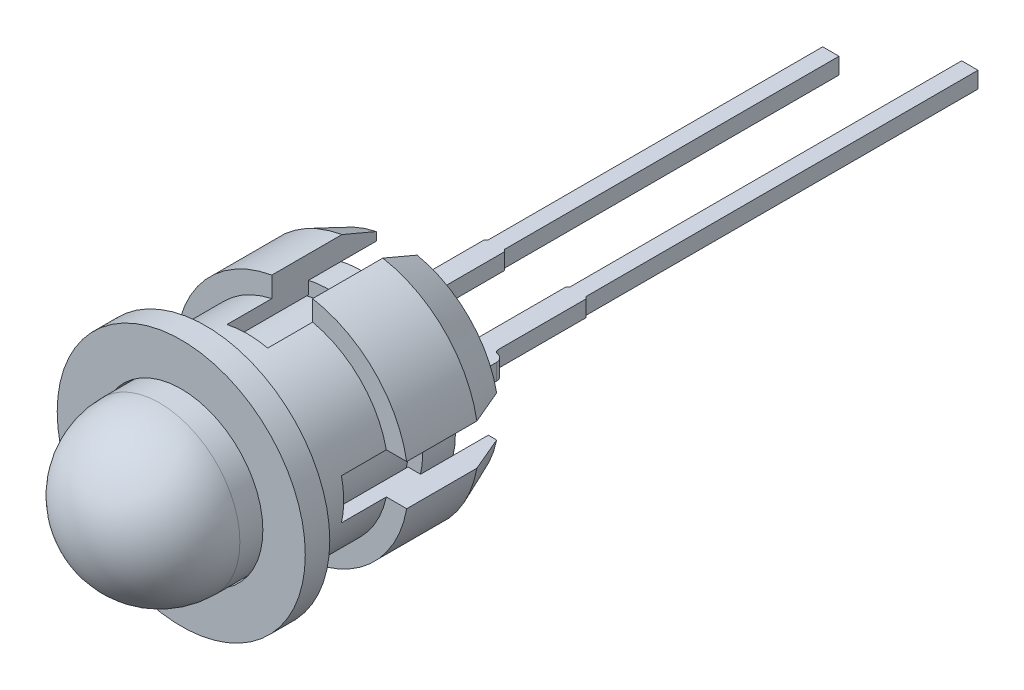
ISO-10303-21;
HEADER;
FILE_DESCRIPTION(('STEP AP214'),'2;1');
FILE_NAME('part.step','',(''),(''),'','','');
FILE_SCHEMA(('AUTOMOTIVE_DESIGN { 1 0 10303 214 1 1 1 1 }'));
ENDSEC;
DATA;
#1=APPLICATION_CONTEXT('core data for automotive mechanical design processes');
#2=APPLICATION_PROTOCOL_DEFINITION('international standard','automotive_design',2000,#1);
#3=PRODUCT_CONTEXT('',#1,'mechanical');
#4=PRODUCT('Part','Part','',(#3));
#5=PRODUCT_RELATED_PRODUCT_CATEGORY('part','',(#4));
#6=PRODUCT_DEFINITION_FORMATION('','',#4);
#7=PRODUCT_DEFINITION_CONTEXT('part definition',#1,'design');
#8=PRODUCT_DEFINITION('design','',#6,#7);
#9=PRODUCT_DEFINITION_SHAPE('','',#8);
#10=(LENGTH_UNIT() NAMED_UNIT(*) SI_UNIT(.MILLI.,.METRE.));
#11=(NAMED_UNIT(*) PLANE_ANGLE_UNIT() SI_UNIT($,.RADIAN.));
#12=(NAMED_UNIT(*) SI_UNIT($,.STERADIAN.) SOLID_ANGLE_UNIT());
#13=UNCERTAINTY_MEASURE_WITH_UNIT(LENGTH_MEASURE(1.E-05),#10,'distance_accuracy_value','');
#14=(GEOMETRIC_REPRESENTATION_CONTEXT(3) GLOBAL_UNCERTAINTY_ASSIGNED_CONTEXT((#13)) GLOBAL_UNIT_ASSIGNED_CONTEXT((#10,
#11,#12)) REPRESENTATION_CONTEXT('',''));
#15=CARTESIAN_POINT('',(0.,0.,0.));
#16=DIRECTION('',(0.,0.,1.));
#17=DIRECTION('',(1.,0.,0.));
#18=AXIS2_PLACEMENT_3D('',#15,#16,#17);
#19=CARTESIAN_POINT('',(0.,0.,10.2231613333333));
#20=DIRECTION('',(0.,0.,1.));
#21=DIRECTION('',(1.,0.,0.));
#22=AXIS2_PLACEMENT_3D('',#19,#20,#21);
#23=CYLINDRICAL_SURFACE('',#22,2.921);
#24=CARTESIAN_POINT('',(0.,0.,1.016));
#25=DIRECTION('',(0.,0.,1.));
#26=DIRECTION('',(1.,0.,0.));
#27=AXIS2_PLACEMENT_3D('',#24,#25,#26);
#28=CIRCLE('',#27,2.921);
#29=CARTESIAN_POINT('',(0.635,-2.85114292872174,1.016));
#30=VERTEX_POINT('',#29);
#31=CARTESIAN_POINT('',(2.85114292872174,-0.63500000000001,1.016));
#32=VERTEX_POINT('',#31);
#33=EDGE_CURVE('E462',#30,#32,#28,.T.);
#34=ORIENTED_EDGE('',*,*,#33,.T.);
#35=DIRECTION('',(0.,0.,1.));
#36=VECTOR('',#35,1.);
#37=CARTESIAN_POINT('',(2.85114292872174,-0.63500000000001,10.2231613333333));
#38=LINE('',#37,#36);
#39=CARTESIAN_POINT('',(2.85114292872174,-0.63500000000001,-1.0922));
#40=VERTEX_POINT('',#39);
#41=EDGE_CURVE('E581',#32,#40,#38,.F.);
#42=ORIENTED_EDGE('',*,*,#41,.T.);
#43=CARTESIAN_POINT('',(0.,0.,-1.0922));
#44=DIRECTION('',(0.,0.,1.));
#45=DIRECTION('',(1.,0.,0.));
#46=AXIS2_PLACEMENT_3D('',#43,#44,#45);
#47=CIRCLE('',#46,2.921);
#48=CARTESIAN_POINT('',(0.635,-2.85114292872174,-1.0922));
#49=VERTEX_POINT('',#48);
#50=EDGE_CURVE('E508',#49,#40,#47,.T.);
#51=ORIENTED_EDGE('',*,*,#50,.F.);
#52=DIRECTION('',(0.,0.,1.));
#53=VECTOR('',#52,1.);
#54=CARTESIAN_POINT('',(0.635,-2.85114292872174,10.2231613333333));
#55=LINE('',#54,#53);
#56=EDGE_CURVE('E416',#49,#30,#55,.T.);
#57=ORIENTED_EDGE('',*,*,#56,.T.);
#58=EDGE_LOOP('',(#34,#42,#51,#57));
#59=FACE_BOUND('',#58,.T.);
#60=ADVANCED_FACE('F46',(#59),#23,.F.);
#61=CARTESIAN_POINT('',(0.,1.81519030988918,-1.0922));
#62=DIRECTION('',(0.,0.,-1.));
#63=DIRECTION('',(-1.,0.,0.));
#64=AXIS2_PLACEMENT_3D('',#61,#62,#63);
#65=PLANE('',#64);
#66=ORIENTED_EDGE('',*,*,#50,.T.);
#67=DIRECTION('',(1.,0.,0.));
#68=VECTOR('',#67,1.);
#69=CARTESIAN_POINT('',(1.81519030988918,-0.635000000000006,-1.0922));
#70=LINE('',#69,#68);
#71=CARTESIAN_POINT('',(3.11085197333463,-0.635000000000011,-1.0922));
#72=VERTEX_POINT('',#71);
#73=EDGE_CURVE('E576',#40,#72,#70,.T.);
#74=ORIENTED_EDGE('',*,*,#73,.T.);
#75=CARTESIAN_POINT('',(0.,0.,-1.0922));
#76=DIRECTION('',(0.,0.,1.));
#77=DIRECTION('',(1.,0.,0.));
#78=AXIS2_PLACEMENT_3D('',#75,#76,#77);
#79=CIRCLE('',#78,3.175);
#80=CARTESIAN_POINT('',(0.635,-3.11085197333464,-1.0922));
#81=VERTEX_POINT('',#80);
#82=EDGE_CURVE('E502',#81,#72,#79,.T.);
#83=ORIENTED_EDGE('',*,*,#82,.F.);
#84=DIRECTION('',(0.,1.,0.));
#85=VECTOR('',#84,1.);
#86=CARTESIAN_POINT('',(0.635,1.81519030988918,-1.0922));
#87=LINE('',#86,#85);
#88=EDGE_CURVE('E383',#81,#49,#87,.T.);
#89=ORIENTED_EDGE('',*,*,#88,.T.);
#90=EDGE_LOOP('',(#66,#74,#83,#89));
#91=FACE_BOUND('',#90,.T.);
#92=ADVANCED_FACE('F725',(#91),#65,.T.);
#93=CARTESIAN_POINT('',(0.,0.,-0.0254000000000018));
#94=DIRECTION('',(0.,0.,1.));
#95=DIRECTION('',(1.,0.,0.));
#96=AXIS2_PLACEMENT_3D('',#93,#94,#95);
#97=CONICAL_SURFACE('',#96,3.6195,0.394791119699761);
#98=ORIENTED_EDGE('',*,*,#82,.T.);
#99=CARTESIAN_POINT('',(1.33723094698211,-0.635000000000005,-5.15937987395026));
#100=CARTESIAN_POINT('',(1.37455038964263,-0.635000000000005,-5.07846123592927));
#101=CARTESIAN_POINT('',(1.41164119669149,-0.635000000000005,-4.99743770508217));
#102=CARTESIAN_POINT('',(1.48544380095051,-0.635000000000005,-4.83521884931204));
#103=CARTESIAN_POINT('',(1.52215560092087,-0.635000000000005,-4.75402352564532));
#104=CARTESIAN_POINT('',(1.63183904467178,-0.635000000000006,-4.51023873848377));
#105=CARTESIAN_POINT('',(1.70436040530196,-0.635000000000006,-4.34744681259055));
#106=CARTESIAN_POINT('',(1.84858146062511,-0.635000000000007,-4.02150927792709));
#107=CARTESIAN_POINT('',(1.92028119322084,-0.635000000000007,-3.85836368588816));
#108=CARTESIAN_POINT('',(2.06308991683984,-0.635000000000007,-3.53181300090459));
#109=CARTESIAN_POINT('',(2.13419890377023,-0.635000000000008,-3.36840790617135));
#110=CARTESIAN_POINT('',(2.3796880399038,-0.635000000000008,-2.80226694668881));
#111=CARTESIAN_POINT('',(2.55298719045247,-0.635000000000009,-2.39906270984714));
#112=CARTESIAN_POINT('',(2.89822663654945,-0.63500000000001,-1.59206064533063));
#113=CARTESIAN_POINT('',(3.07016689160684,-0.635000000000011,-1.1882628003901));
#114=CARTESIAN_POINT('',(3.39709100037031,-0.635000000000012,-0.418277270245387));
#115=CARTESIAN_POINT('',(3.55214980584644,-0.635000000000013,-0.0521214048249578));
#116=CARTESIAN_POINT('',(3.86180545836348,-0.635000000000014,0.680385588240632));
#117=CARTESIAN_POINT('',(4.01640230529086,-0.635000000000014,1.04673671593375));
#118=CARTESIAN_POINT('',(4.32526030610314,-0.635000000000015,1.77955004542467));
#119=CARTESIAN_POINT('',(4.47952148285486,-0.635000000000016,2.14601223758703));
#120=CARTESIAN_POINT('',(4.78780031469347,-0.635000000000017,2.87903860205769));
#121=CARTESIAN_POINT('',(4.94181797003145,-0.635000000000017,3.24560277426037));
#122=CARTESIAN_POINT('',(5.09575465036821,-0.635000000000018,3.61220087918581));
#123=B_SPLINE_CURVE_WITH_KNOTS('',3,(#99,#100,#101,#102,#103,#104,#105,#106,#107,#108,#109,#110,
#111,#112,#113,#114,#115,#116,#117,#118,#119,#120,#121,#122),.UNSPECIFIED.,.F.,.F.,(4,2,2,2,2,2,
2,2,2,2,2,4),(0.,0.267328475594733,0.534655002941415,1.06929602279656,1.60391227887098,
2.13853223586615,3.45513401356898,4.77177487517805,5.96467841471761,7.15758224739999,
8.3504020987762,9.54322071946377),.UNSPECIFIED.);
#124=CARTESIAN_POINT('',(3.56336291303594,-0.635000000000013,-0.0254000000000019));
#125=VERTEX_POINT('',#124);
#126=EDGE_CURVE('E569',#72,#125,#123,.T.);
#127=ORIENTED_EDGE('',*,*,#126,.T.);
#128=CARTESIAN_POINT('',(0.,0.,-0.0254000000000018));
#129=DIRECTION('',(0.,0.,1.));
#130=DIRECTION('',(1.,0.,0.));
#131=AXIS2_PLACEMENT_3D('',#128,#129,#130);
#132=CIRCLE('',#131,3.6195);
#133=CARTESIAN_POINT('',(0.635,-3.56336291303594,-0.0254000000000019));
#134=VERTEX_POINT('',#133);
#135=EDGE_CURVE('E496',#134,#125,#132,.T.);
#136=ORIENTED_EDGE('',*,*,#135,.F.);
#137=CARTESIAN_POINT('',(0.635,-5.09575465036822,3.61220087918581));
#138=CARTESIAN_POINT('',(0.635,-4.94180944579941,3.24558251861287));
#139=CARTESIAN_POINT('',(0.635,-4.7877832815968,2.87899808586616));
#140=CARTESIAN_POINT('',(0.635,-4.47948834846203,2.14593346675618));
#141=CARTESIAN_POINT('',(0.635,-4.32521958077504,1.77945327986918));
#142=CARTESIAN_POINT('',(0.635,-4.01636239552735,1.04664216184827));
#143=CARTESIAN_POINT('',(0.635,-3.86177398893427,0.68031122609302));
#144=CARTESIAN_POINT('',(0.635,-3.55213455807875,-0.0521575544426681));
#145=CARTESIAN_POINT('',(0.635,-3.39708353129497,-0.418295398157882));
#146=CARTESIAN_POINT('',(0.635,-3.08628552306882,-1.15029897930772));
#147=CARTESIAN_POINT('',(0.635,-2.93053850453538,-1.51616470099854));
#148=CARTESIAN_POINT('',(0.635,-2.61797235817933,-2.24743344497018));
#149=CARTESIAN_POINT('',(0.635,-2.46115324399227,-2.61283647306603));
#150=CARTESIAN_POINT('',(0.635,-2.22450972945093,-3.16034137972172));
#151=CARTESIAN_POINT('',(0.635,-2.14539064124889,-3.34274788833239));
#152=CARTESIAN_POINT('',(0.635,-1.9864943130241,-3.70727260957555));
#153=CARTESIAN_POINT('',(0.635,-1.90671707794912,-3.8893908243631));
#154=CARTESIAN_POINT('',(0.635,-1.74622227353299,-4.25322337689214));
#155=CARTESIAN_POINT('',(0.635,-1.66550466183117,-4.43493769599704));
#156=CARTESIAN_POINT('',(0.635,-1.54336065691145,-4.70703310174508));
#157=CARTESIAN_POINT('',(0.635,-1.5024675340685,-4.79765336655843));
#158=CARTESIAN_POINT('',(0.635,-1.42022073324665,-4.97868553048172));
#159=CARTESIAN_POINT('',(0.635,-1.37886705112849,-5.06909742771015));
#160=CARTESIAN_POINT('',(0.635,-1.33723094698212,-5.15937987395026));
#161=B_SPLINE_CURVE_WITH_KNOTS('',3,(#137,#138,#139,#140,#141,#142,#143,#144,#145,#146,#147,
#148,#149,#150,#151,#152,#153,#154,#155,#156,#157,#158,#159,#160),.UNSPECIFIED.,.F.,.F.,(4,2,2,
2,2,2,2,2,2,2,2,4),(0.,1.19288454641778,2.38576299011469,3.57860116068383,4.77144584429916,
5.96435487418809,7.15724876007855,7.75372722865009,8.35020121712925,8.94670217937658,
9.24496019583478,9.54322089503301),.UNSPECIFIED.);
#162=EDGE_CURVE('E408',#134,#81,#161,.T.);
#163=ORIENTED_EDGE('',*,*,#162,.T.);
#164=EDGE_LOOP('',(#98,#127,#136,#163));
#165=FACE_BOUND('',#164,.T.);
#166=ADVANCED_FACE('F729',(#165),#97,.T.);
#167=CARTESIAN_POINT('',(0.,0.,10.2231613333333));
#168=DIRECTION('',(0.,0.,1.));
#169=DIRECTION('',(1.,0.,0.));
#170=AXIS2_PLACEMENT_3D('',#167,#168,#169);
#171=CYLINDRICAL_SURFACE('',#170,3.6195);
#172=ORIENTED_EDGE('',*,*,#135,.T.);
#173=DIRECTION('',(0.,0.,1.));
#174=VECTOR('',#173,1.);
#175=CARTESIAN_POINT('',(3.56336291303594,-0.635000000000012,10.2231613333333));
#176=LINE('',#175,#174);
#177=CARTESIAN_POINT('',(3.56336291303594,-0.635000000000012,2.159));
#178=VERTEX_POINT('',#177);
#179=EDGE_CURVE('E577',#125,#178,#176,.T.);
#180=ORIENTED_EDGE('',*,*,#179,.T.);
#181=CARTESIAN_POINT('',(0.,0.,2.159));
#182=DIRECTION('',(0.,0.,1.));
#183=DIRECTION('',(1.,0.,0.));
#184=AXIS2_PLACEMENT_3D('',#181,#182,#183);
#185=CIRCLE('',#184,3.6195);
#186=CARTESIAN_POINT('',(0.635,-3.56336291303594,2.159));
#187=VERTEX_POINT('',#186);
#188=EDGE_CURVE('E490',#187,#178,#185,.T.);
#189=ORIENTED_EDGE('',*,*,#188,.F.);
#190=DIRECTION('',(0.,0.,1.));
#191=VECTOR('',#190,1.);
#192=CARTESIAN_POINT('',(0.635,-3.56336291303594,10.2231613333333));
#193=LINE('',#192,#191);
#194=EDGE_CURVE('E415',#187,#134,#193,.F.);
#195=ORIENTED_EDGE('',*,*,#194,.T.);
#196=EDGE_LOOP('',(#172,#180,#189,#195));
#197=FACE_BOUND('',#196,.T.);
#198=ADVANCED_FACE('F601',(#197),#171,.T.);
#199=CARTESIAN_POINT('',(0.,1.8151903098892,2.159));
#200=DIRECTION('',(0.,0.,1.));
#201=DIRECTION('',(1.,0.,0.));
#202=AXIS2_PLACEMENT_3D('',#199,#200,#201);
#203=PLANE('',#202);
#204=ORIENTED_EDGE('',*,*,#188,.T.);
#205=DIRECTION('',(-1.,0.,0.));
#206=VECTOR('',#205,1.);
#207=CARTESIAN_POINT('',(1.81519030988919,-0.635000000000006,2.159));
#208=LINE('',#207,#206);
#209=CARTESIAN_POINT('',(2.92916077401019,-0.63500000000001,2.159));
#210=VERTEX_POINT('',#209);
#211=EDGE_CURVE('E603',#178,#210,#208,.T.);
#212=ORIENTED_EDGE('',*,*,#211,.T.);
#213=CARTESIAN_POINT('',(0.,0.,2.159));
#214=DIRECTION('',(0.,0.,1.));
#215=DIRECTION('',(1.,0.,0.));
#216=AXIS2_PLACEMENT_3D('',#213,#214,#215);
#217=CIRCLE('',#216,2.9972);
#218=CARTESIAN_POINT('',(0.635,-2.92916077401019,2.159));
#219=VERTEX_POINT('',#218);
#220=EDGE_CURVE('E299',#219,#210,#217,.T.);
#221=ORIENTED_EDGE('',*,*,#220,.F.);
#222=DIRECTION('',(0.,-1.,0.));
#223=VECTOR('',#222,1.);
#224=CARTESIAN_POINT('',(0.635,1.8151903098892,2.159));
#225=LINE('',#224,#223);
#226=EDGE_CURVE('E420',#219,#187,#225,.T.);
#227=ORIENTED_EDGE('',*,*,#226,.T.);
#228=EDGE_LOOP('',(#204,#212,#221,#227));
#229=FACE_BOUND('',#228,.T.);
#230=ADVANCED_FACE('F598',(#229),#203,.T.);
#231=CARTESIAN_POINT('',(0.,1.81519030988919,1.016));
#232=DIRECTION('',(0.,0.,-1.));
#233=DIRECTION('',(-1.,0.,0.));
#234=AXIS2_PLACEMENT_3D('',#231,#232,#233);
#235=PLANE('',#234);
#236=CARTESIAN_POINT('',(0.,0.,1.016));
#237=DIRECTION('',(0.,0.,1.));
#238=DIRECTION('',(1.,0.,0.));
#239=AXIS2_PLACEMENT_3D('',#236,#237,#238);
#240=CIRCLE('',#239,2.54);
#241=CARTESIAN_POINT('',(0.635,-2.45934442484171,1.016));
#242=VERTEX_POINT('',#241);
#243=CARTESIAN_POINT('',(2.45934442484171,-0.635000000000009,1.016));
#244=VERTEX_POINT('',#243);
#245=EDGE_CURVE('E468',#242,#244,#240,.T.);
#246=ORIENTED_EDGE('',*,*,#245,.T.);
#247=DIRECTION('',(1.,0.,0.));
#248=VECTOR('',#247,1.);
#249=CARTESIAN_POINT('',(1.81519030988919,-0.635000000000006,1.016));
#250=LINE('',#249,#248);
#251=EDGE_CURVE('E304',#244,#32,#250,.T.);
#252=ORIENTED_EDGE('',*,*,#251,.T.);
#253=ORIENTED_EDGE('',*,*,#33,.F.);
#254=DIRECTION('',(0.,1.,0.));
#255=VECTOR('',#254,1.);
#256=CARTESIAN_POINT('',(0.635,1.81519030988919,1.016));
#257=LINE('',#256,#255);
#258=EDGE_CURVE('E516',#30,#242,#257,.T.);
#259=ORIENTED_EDGE('',*,*,#258,.T.);
#260=EDGE_LOOP('',(#246,#252,#253,#259));
#261=FACE_BOUND('',#260,.T.);
#262=ADVANCED_FACE('F527',(#261),#235,.T.);
#263=CARTESIAN_POINT('',(0.,0.,10.2231613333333));
#264=DIRECTION('',(0.,0.,1.));
#265=DIRECTION('',(1.,0.,0.));
#266=AXIS2_PLACEMENT_3D('',#263,#264,#265);
#267=CYLINDRICAL_SURFACE('',#266,2.9972);
#268=CARTESIAN_POINT('',(0.,0.,4.8514));
#269=DIRECTION('',(0.,0.,1.));
#270=DIRECTION('',(1.,0.,0.));
#271=AXIS2_PLACEMENT_3D('',#268,#269,#270);
#272=CIRCLE('',#271,2.9972);
#273=CARTESIAN_POINT('',(2.9972,0.,4.8514));
#274=VERTEX_POINT('',#273);
#275=EDGE_CURVE('E483',#274,#274,#272,.T.);
#276=ORIENTED_EDGE('',*,*,#275,.F.);
#277=EDGE_LOOP('',(#276));
#278=FACE_BOUND('',#277,.T.);
#279=ORIENTED_EDGE('',*,*,#220,.T.);
#280=DIRECTION('',(0.,0.,1.));
#281=VECTOR('',#280,1.);
#282=CARTESIAN_POINT('',(2.92916077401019,-0.63500000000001,10.2231613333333));
#283=LINE('',#282,#281);
#284=CARTESIAN_POINT('',(2.92916077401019,-0.63500000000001,3.556));
#285=VERTEX_POINT('',#284);
#286=EDGE_CURVE('E291',#210,#285,#283,.T.);
#287=ORIENTED_EDGE('',*,*,#286,.T.);
#288=CARTESIAN_POINT('',(0.,0.,3.556));
#289=DIRECTION('',(0.,0.,1.));
#290=DIRECTION('',(0.,-1.,0.));
#291=AXIS2_PLACEMENT_3D('',#288,#289,#290);
#292=CIRCLE('',#291,2.9972);
#293=CARTESIAN_POINT('',(2.9291607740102,0.63499999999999,3.556));
#294=VERTEX_POINT('',#293);
#295=EDGE_CURVE('E279',#294,#285,#292,.F.);
#296=ORIENTED_EDGE('',*,*,#295,.F.);
#297=DIRECTION('',(0.,0.,1.));
#298=VECTOR('',#297,1.);
#299=CARTESIAN_POINT('',(2.9291607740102,0.63499999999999,10.2231613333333));
#300=LINE('',#299,#298);
#301=CARTESIAN_POINT('',(2.9291607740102,0.63499999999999,2.159));
#302=VERTEX_POINT('',#301);
#303=EDGE_CURVE('E540',#302,#294,#300,.T.);
#304=ORIENTED_EDGE('',*,*,#303,.F.);
#305=CARTESIAN_POINT('',(0.635,2.92916077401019,2.159));
#306=VERTEX_POINT('',#305);
#307=EDGE_CURVE('E486',#302,#306,#217,.T.);
#308=ORIENTED_EDGE('',*,*,#307,.T.);
#309=DIRECTION('',(0.,0.,1.));
#310=VECTOR('',#309,1.);
#311=CARTESIAN_POINT('',(0.635,2.92916077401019,10.2231613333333));
#312=LINE('',#311,#310);
#313=CARTESIAN_POINT('',(0.635,2.92916077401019,3.556));
#314=VERTEX_POINT('',#313);
#315=EDGE_CURVE('E586',#306,#314,#312,.T.);
#316=ORIENTED_EDGE('',*,*,#315,.T.);
#317=CARTESIAN_POINT('',(0.,0.,3.556));
#318=DIRECTION('',(0.,0.,1.));
#319=DIRECTION('',(1.,0.,0.));
#320=AXIS2_PLACEMENT_3D('',#317,#318,#319);
#321=CIRCLE('',#320,2.9972);
#322=CARTESIAN_POINT('',(-0.635,2.92916077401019,3.556));
#323=VERTEX_POINT('',#322);
#324=EDGE_CURVE('E459',#323,#314,#321,.F.);
#325=ORIENTED_EDGE('',*,*,#324,.F.);
#326=DIRECTION('',(0.,0.,1.));
#327=VECTOR('',#326,1.);
#328=CARTESIAN_POINT('',(-0.635,2.92916077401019,10.2231613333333));
#329=LINE('',#328,#327);
#330=CARTESIAN_POINT('',(-0.635,2.92916077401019,2.159));
#331=VERTEX_POINT('',#330);
#332=EDGE_CURVE('E439',#331,#323,#329,.T.);
#333=ORIENTED_EDGE('',*,*,#332,.F.);
#334=CARTESIAN_POINT('',(-2.92916077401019,0.63500000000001,2.159));
#335=VERTEX_POINT('',#334);
#336=EDGE_CURVE('E489',#331,#335,#217,.T.);
#337=ORIENTED_EDGE('',*,*,#336,.T.);
#338=DIRECTION('',(0.,0.,1.));
#339=VECTOR('',#338,1.);
#340=CARTESIAN_POINT('',(-2.92916077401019,0.63500000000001,10.2231613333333));
#341=LINE('',#340,#339);
#342=CARTESIAN_POINT('',(-2.92916077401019,0.63500000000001,3.556));
#343=VERTEX_POINT('',#342);
#344=EDGE_CURVE('E709',#343,#335,#341,.F.);
#345=ORIENTED_EDGE('',*,*,#344,.F.);
#346=CARTESIAN_POINT('',(0.,0.,3.556));
#347=DIRECTION('',(0.,0.,1.));
#348=DIRECTION('',(0.,-1.,0.));
#349=AXIS2_PLACEMENT_3D('',#346,#347,#348);
#350=CIRCLE('',#349,2.9972);
#351=CARTESIAN_POINT('',(-2.9291607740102,-0.63499999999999,3.556));
#352=VERTEX_POINT('',#351);
#353=EDGE_CURVE('E300',#352,#343,#350,.F.);
#354=ORIENTED_EDGE('',*,*,#353,.F.);
#355=DIRECTION('',(0.,0.,1.));
#356=VECTOR('',#355,1.);
#357=CARTESIAN_POINT('',(-2.9291607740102,-0.63499999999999,10.2231613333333));
#358=LINE('',#357,#356);
#359=CARTESIAN_POINT('',(-2.9291607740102,-0.63499999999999,2.159));
#360=VERTEX_POINT('',#359);
#361=EDGE_CURVE('E694',#352,#360,#358,.F.);
#362=ORIENTED_EDGE('',*,*,#361,.T.);
#363=CARTESIAN_POINT('',(-0.635,-2.92916077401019,2.159));
#364=VERTEX_POINT('',#363);
#365=EDGE_CURVE('E488',#360,#364,#217,.T.);
#366=ORIENTED_EDGE('',*,*,#365,.T.);
#367=DIRECTION('',(0.,0.,1.));
#368=VECTOR('',#367,1.);
#369=CARTESIAN_POINT('',(-0.635,-2.92916077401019,10.2231613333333));
#370=LINE('',#369,#368);
#371=CARTESIAN_POINT('',(-0.635,-2.92916077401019,3.556));
#372=VERTEX_POINT('',#371);
#373=EDGE_CURVE('E456',#372,#364,#370,.F.);
#374=ORIENTED_EDGE('',*,*,#373,.F.);
#375=CARTESIAN_POINT('',(0.635,-2.92916077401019,3.556));
#376=VERTEX_POINT('',#375);
#377=EDGE_CURVE('E461',#376,#372,#321,.F.);
#378=ORIENTED_EDGE('',*,*,#377,.F.);
#379=DIRECTION('',(0.,0.,1.));
#380=VECTOR('',#379,1.);
#381=CARTESIAN_POINT('',(0.635,-2.92916077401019,10.2231613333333));
#382=LINE('',#381,#380);
#383=EDGE_CURVE('E421',#376,#219,#382,.F.);
#384=ORIENTED_EDGE('',*,*,#383,.T.);
#385=EDGE_LOOP('',(#279,#287,#296,#304,#308,#316,#325,#333,#337,#345,#354,#362,#366,#374,#378,#384));
#386=FACE_BOUND('',#385,.T.);
#387=ADVANCED_FACE('F296',(#278,#386),#267,.T.);
#388=CARTESIAN_POINT('',(0.,0.,10.2231613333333));
#389=DIRECTION('',(0.,0.,1.));
#390=DIRECTION('',(1.,0.,0.));
#391=AXIS2_PLACEMENT_3D('',#388,#389,#390);
#392=CYLINDRICAL_SURFACE('',#391,2.54);
#393=CARTESIAN_POINT('',(0.,0.,5.6134));
#394=DIRECTION('',(0.,0.,1.));
#395=DIRECTION('',(1.,0.,0.));
#396=AXIS2_PLACEMENT_3D('',#393,#394,#395);
#397=CIRCLE('',#396,2.54);
#398=CARTESIAN_POINT('',(2.54,0.,5.6134));
#399=VERTEX_POINT('',#398);
#400=EDGE_CURVE('E474',#399,#399,#397,.T.);
#401=ORIENTED_EDGE('',*,*,#400,.T.);
#402=EDGE_LOOP('',(#401));
#403=FACE_BOUND('',#402,.T.);
#404=CARTESIAN_POINT('',(0.,0.,3.556));
#405=DIRECTION('',(0.,0.,1.));
#406=DIRECTION('',(0.,-1.,0.));
#407=AXIS2_PLACEMENT_3D('',#404,#405,#406);
#408=CIRCLE('',#407,2.54);
#409=CARTESIAN_POINT('',(2.45934442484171,-0.635000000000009,3.556));
#410=VERTEX_POINT('',#409);
#411=CARTESIAN_POINT('',(2.45934442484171,0.634999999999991,3.556));
#412=VERTEX_POINT('',#411);
#413=EDGE_CURVE('E293',#410,#412,#408,.T.);
#414=ORIENTED_EDGE('',*,*,#413,.F.);
#415=DIRECTION('',(0.,0.,1.));
#416=VECTOR('',#415,1.);
#417=CARTESIAN_POINT('',(2.45934442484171,-0.635000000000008,10.2231613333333));
#418=LINE('',#417,#416);
#419=EDGE_CURVE('E61',#410,#244,#418,.F.);
#420=ORIENTED_EDGE('',*,*,#419,.T.);
#421=ORIENTED_EDGE('',*,*,#245,.F.);
#422=DIRECTION('',(0.,0.,1.));
#423=VECTOR('',#422,1.);
#424=CARTESIAN_POINT('',(0.635,-2.45934442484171,10.2231613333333));
#425=LINE('',#424,#423);
#426=CARTESIAN_POINT('',(0.635,-2.45934442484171,3.556));
#427=VERTEX_POINT('',#426);
#428=EDGE_CURVE('E535',#242,#427,#425,.T.);
#429=ORIENTED_EDGE('',*,*,#428,.T.);
#430=CARTESIAN_POINT('',(0.,0.,3.556));
#431=DIRECTION('',(0.,0.,1.));
#432=DIRECTION('',(1.,0.,0.));
#433=AXIS2_PLACEMENT_3D('',#430,#431,#432);
#434=CIRCLE('',#433,2.54);
#435=CARTESIAN_POINT('',(-0.635,-2.45934442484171,3.556));
#436=VERTEX_POINT('',#435);
#437=EDGE_CURVE('E50',#436,#427,#434,.T.);
#438=ORIENTED_EDGE('',*,*,#437,.F.);
#439=DIRECTION('',(0.,0.,1.));
#440=VECTOR('',#439,1.);
#441=CARTESIAN_POINT('',(-0.635,-2.45934442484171,10.2231613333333));
#442=LINE('',#441,#440);
#443=CARTESIAN_POINT('',(-0.635,-2.45934442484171,1.016));
#444=VERTEX_POINT('',#443);
#445=EDGE_CURVE('E442',#444,#436,#442,.T.);
#446=ORIENTED_EDGE('',*,*,#445,.F.);
#447=CARTESIAN_POINT('',(-2.45934442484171,-0.634999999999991,1.016));
#448=VERTEX_POINT('',#447);
#449=EDGE_CURVE('E471',#448,#444,#240,.T.);
#450=ORIENTED_EDGE('',*,*,#449,.F.);
#451=DIRECTION('',(0.,0.,1.));
#452=VECTOR('',#451,1.);
#453=CARTESIAN_POINT('',(-2.45934442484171,-0.634999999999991,10.2231613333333));
#454=LINE('',#453,#452);
#455=CARTESIAN_POINT('',(-2.45934442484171,-0.634999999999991,3.556));
#456=VERTEX_POINT('',#455);
#457=EDGE_CURVE('E69',#448,#456,#454,.T.);
#458=ORIENTED_EDGE('',*,*,#457,.T.);
#459=CARTESIAN_POINT('',(0.,0.,3.556));
#460=DIRECTION('',(0.,0.,1.));
#461=DIRECTION('',(0.,-1.,0.));
#462=AXIS2_PLACEMENT_3D('',#459,#460,#461);
#463=CIRCLE('',#462,2.54);
#464=CARTESIAN_POINT('',(-2.45934442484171,0.635000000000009,3.556));
#465=VERTEX_POINT('',#464);
#466=EDGE_CURVE('E310',#465,#456,#463,.T.);
#467=ORIENTED_EDGE('',*,*,#466,.F.);
#468=DIRECTION('',(0.,0.,1.));
#469=VECTOR('',#468,1.);
#470=CARTESIAN_POINT('',(-2.45934442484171,0.635000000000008,10.2231613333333));
#471=LINE('',#470,#469);
#472=CARTESIAN_POINT('',(-2.45934442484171,0.635000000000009,1.016));
#473=VERTEX_POINT('',#472);
#474=EDGE_CURVE('E362',#473,#465,#471,.T.);
#475=ORIENTED_EDGE('',*,*,#474,.F.);
#476=CARTESIAN_POINT('',(-0.635,2.45934442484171,1.016));
#477=VERTEX_POINT('',#476);
#478=EDGE_CURVE('E473',#477,#473,#240,.T.);
#479=ORIENTED_EDGE('',*,*,#478,.F.);
#480=DIRECTION('',(0.,0.,1.));
#481=VECTOR('',#480,1.);
#482=CARTESIAN_POINT('',(-0.635,2.45934442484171,10.2231613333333));
#483=LINE('',#482,#481);
#484=CARTESIAN_POINT('',(-0.635,2.45934442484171,3.556));
#485=VERTEX_POINT('',#484);
#486=EDGE_CURVE('E423',#485,#477,#483,.F.);
#487=ORIENTED_EDGE('',*,*,#486,.F.);
#488=CARTESIAN_POINT('',(0.635,2.45934442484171,3.556));
#489=VERTEX_POINT('',#488);
#490=EDGE_CURVE('E12',#489,#485,#434,.T.);
#491=ORIENTED_EDGE('',*,*,#490,.F.);
#492=DIRECTION('',(0.,0.,1.));
#493=VECTOR('',#492,1.);
#494=CARTESIAN_POINT('',(0.635,2.45934442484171,10.2231613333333));
#495=LINE('',#494,#493);
#496=CARTESIAN_POINT('',(0.635,2.45934442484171,1.016));
#497=VERTEX_POINT('',#496);
#498=EDGE_CURVE('E373',#489,#497,#495,.F.);
#499=ORIENTED_EDGE('',*,*,#498,.T.);
#500=CARTESIAN_POINT('',(2.45934442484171,0.634999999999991,1.016));
#501=VERTEX_POINT('',#500);
#502=EDGE_CURVE('E472',#501,#497,#240,.T.);
#503=ORIENTED_EDGE('',*,*,#502,.F.);
#504=DIRECTION('',(0.,0.,1.));
#505=VECTOR('',#504,1.);
#506=CARTESIAN_POINT('',(2.45934442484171,0.634999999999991,10.2231613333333));
#507=LINE('',#506,#505);
#508=EDGE_CURVE('E538',#412,#501,#507,.F.);
#509=ORIENTED_EDGE('',*,*,#508,.F.);
#510=EDGE_LOOP('',(#414,#420,#421,#429,#438,#446,#450,#458,#467,#475,#479,#487,#491,#499,#503,#509));
#511=FACE_BOUND('',#510,.T.);
#512=ADVANCED_FACE('F533',(#403,#511),#392,.F.);
#513=CARTESIAN_POINT('',(-2.85114292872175,-0.63499999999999,-1.0922));
#514=VERTEX_POINT('',#513);
#515=CARTESIAN_POINT('',(-0.635,-2.85114292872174,-1.0922));
#516=VERTEX_POINT('',#515);
#517=EDGE_CURVE('E511',#514,#516,#47,.T.);
#518=ORIENTED_EDGE('',*,*,#517,.F.);
#519=DIRECTION('',(0.,0.,1.));
#520=VECTOR('',#519,1.);
#521=CARTESIAN_POINT('',(-2.85114292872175,-0.63499999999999,10.2231613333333));
#522=LINE('',#521,#520);
#523=CARTESIAN_POINT('',(-2.85114292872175,-0.63499999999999,1.016));
#524=VERTEX_POINT('',#523);
#525=EDGE_CURVE('E317',#514,#524,#522,.T.);
#526=ORIENTED_EDGE('',*,*,#525,.T.);
#527=CARTESIAN_POINT('',(-0.635,-2.85114292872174,1.016));
#528=VERTEX_POINT('',#527);
#529=EDGE_CURVE('E465',#524,#528,#28,.T.);
#530=ORIENTED_EDGE('',*,*,#529,.T.);
#531=DIRECTION('',(0.,0.,1.));
#532=VECTOR('',#531,1.);
#533=CARTESIAN_POINT('',(-0.635,-2.85114292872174,10.2231613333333));
#534=LINE('',#533,#532);
#535=EDGE_CURVE('E444',#516,#528,#534,.T.);
#536=ORIENTED_EDGE('',*,*,#535,.F.);
#537=EDGE_LOOP('',(#518,#526,#530,#536));
#538=FACE_BOUND('',#537,.T.);
#539=ADVANCED_FACE('F716',(#538),#23,.F.);
#540=CARTESIAN_POINT('',(-3.11085197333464,-0.634999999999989,-1.0922));
#541=VERTEX_POINT('',#540);
#542=CARTESIAN_POINT('',(-0.635,-3.11085197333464,-1.0922));
#543=VERTEX_POINT('',#542);
#544=EDGE_CURVE('E505',#541,#543,#79,.T.);
#545=ORIENTED_EDGE('',*,*,#544,.F.);
#546=DIRECTION('',(1.,0.,0.));
#547=VECTOR('',#546,1.);
#548=CARTESIAN_POINT('',(1.81519030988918,-0.635000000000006,-1.0922));
#549=LINE('',#548,#547);
#550=EDGE_CURVE('E320',#541,#514,#549,.T.);
#551=ORIENTED_EDGE('',*,*,#550,.T.);
#552=ORIENTED_EDGE('',*,*,#517,.T.);
#553=DIRECTION('',(0.,1.,0.));
#554=VECTOR('',#553,1.);
#555=CARTESIAN_POINT('',(-0.635,1.81519030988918,-1.0922));
#556=LINE('',#555,#554);
#557=EDGE_CURVE('E430',#543,#516,#556,.T.);
#558=ORIENTED_EDGE('',*,*,#557,.F.);
#559=EDGE_LOOP('',(#545,#551,#552,#558));
#560=FACE_BOUND('',#559,.T.);
#561=ADVANCED_FACE('F715',(#560),#65,.T.);
#562=CARTESIAN_POINT('',(-3.56336291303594,-0.634999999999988,-0.0254000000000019));
#563=VERTEX_POINT('',#562);
#564=CARTESIAN_POINT('',(-0.635,-3.56336291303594,-0.0254000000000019));
#565=VERTEX_POINT('',#564);
#566=EDGE_CURVE('E499',#563,#565,#132,.T.);
#567=ORIENTED_EDGE('',*,*,#566,.F.);
#568=CARTESIAN_POINT('',(-5.09575465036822,-0.634999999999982,3.61220087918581));
#569=CARTESIAN_POINT('',(-4.94180944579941,-0.634999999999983,3.24558251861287));
#570=CARTESIAN_POINT('',(-4.78778328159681,-0.634999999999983,2.87899808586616));
#571=CARTESIAN_POINT('',(-4.47948834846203,-0.634999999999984,2.14593346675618));
#572=CARTESIAN_POINT('',(-4.32521958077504,-0.634999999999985,1.77945327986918));
#573=CARTESIAN_POINT('',(-4.01636239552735,-0.634999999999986,1.04664216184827));
#574=CARTESIAN_POINT('',(-3.86177398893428,-0.634999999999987,0.68031122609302));
#575=CARTESIAN_POINT('',(-3.55213455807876,-0.634999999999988,-0.0521575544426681));
#576=CARTESIAN_POINT('',(-3.39708353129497,-0.634999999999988,-0.418295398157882));
#577=CARTESIAN_POINT('',(-3.08628552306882,-0.634999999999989,-1.15029897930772));
#578=CARTESIAN_POINT('',(-2.93053850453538,-0.63499999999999,-1.51616470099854));
#579=CARTESIAN_POINT('',(-2.61797235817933,-0.634999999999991,-2.24743344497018));
#580=CARTESIAN_POINT('',(-2.46115324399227,-0.634999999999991,-2.61283647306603));
#581=CARTESIAN_POINT('',(-2.22450972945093,-0.634999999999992,-3.16034137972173));
#582=CARTESIAN_POINT('',(-2.1453906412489,-0.634999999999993,-3.34274788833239));
#583=CARTESIAN_POINT('',(-1.9864943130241,-0.634999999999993,-3.70727260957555));
#584=CARTESIAN_POINT('',(-1.90671707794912,-0.634999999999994,-3.8893908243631));
#585=CARTESIAN_POINT('',(-1.746222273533,-0.634999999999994,-4.25322337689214));
#586=CARTESIAN_POINT('',(-1.66550466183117,-0.634999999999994,-4.43493769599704));
#587=CARTESIAN_POINT('',(-1.54336065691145,-0.634999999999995,-4.70703310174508));
#588=CARTESIAN_POINT('',(-1.50246753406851,-0.634999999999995,-4.79765336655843));
#589=CARTESIAN_POINT('',(-1.42022073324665,-0.634999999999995,-4.97868553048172));
#590=CARTESIAN_POINT('',(-1.37886705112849,-0.634999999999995,-5.06909742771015));
#591=CARTESIAN_POINT('',(-1.33723094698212,-0.634999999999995,-5.15937987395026));
#592=B_SPLINE_CURVE_WITH_KNOTS('',3,(#568,#569,#570,#571,#572,#573,#574,#575,#576,#577,#578,
#579,#580,#581,#582,#583,#584,#585,#586,#587,#588,#589,#590,#591),.UNSPECIFIED.,.F.,.F.,(4,2,2,
2,2,2,2,2,2,2,2,4),(0.,1.19288454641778,2.3857629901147,3.57860116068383,4.77144584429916,
5.96435487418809,7.15724876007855,7.75372722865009,8.35020121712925,8.94670217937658,
9.24496019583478,9.54322089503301),.UNSPECIFIED.);
#593=EDGE_CURVE('E323',#563,#541,#592,.T.);
#594=ORIENTED_EDGE('',*,*,#593,.T.);
#595=ORIENTED_EDGE('',*,*,#544,.T.);
#596=CARTESIAN_POINT('',(-0.635,-5.09575465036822,3.61220087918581));
#597=CARTESIAN_POINT('',(-0.635,-4.94180944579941,3.24558251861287));
#598=CARTESIAN_POINT('',(-0.635,-4.7877832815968,2.87899808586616));
#599=CARTESIAN_POINT('',(-0.635,-4.47948834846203,2.14593346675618));
#600=CARTESIAN_POINT('',(-0.635,-4.32521958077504,1.77945327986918));
#601=CARTESIAN_POINT('',(-0.635,-4.01636239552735,1.04664216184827));
#602=CARTESIAN_POINT('',(-0.635,-3.86177398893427,0.68031122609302));
#603=CARTESIAN_POINT('',(-0.635,-3.55213455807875,-0.0521575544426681));
#604=CARTESIAN_POINT('',(-0.635,-3.39708353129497,-0.418295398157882));
#605=CARTESIAN_POINT('',(-0.635,-3.08628552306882,-1.15029897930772));
#606=CARTESIAN_POINT('',(-0.635,-2.93053850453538,-1.51616470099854));
#607=CARTESIAN_POINT('',(-0.635,-2.61797235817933,-2.24743344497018));
#608=CARTESIAN_POINT('',(-0.635,-2.46115324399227,-2.61283647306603));
#609=CARTESIAN_POINT('',(-0.635,-2.22450972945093,-3.16034137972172));
#610=CARTESIAN_POINT('',(-0.635,-2.14539064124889,-3.34274788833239));
#611=CARTESIAN_POINT('',(-0.635,-1.9864943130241,-3.70727260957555));
#612=CARTESIAN_POINT('',(-0.635,-1.90671707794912,-3.8893908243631));
#613=CARTESIAN_POINT('',(-0.635,-1.74622227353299,-4.25322337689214));
#614=CARTESIAN_POINT('',(-0.635,-1.66550466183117,-4.43493769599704));
#615=CARTESIAN_POINT('',(-0.635,-1.54336065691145,-4.70703310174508));
#616=CARTESIAN_POINT('',(-0.635,-1.5024675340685,-4.79765336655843));
#617=CARTESIAN_POINT('',(-0.635,-1.42022073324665,-4.97868553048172));
#618=CARTESIAN_POINT('',(-0.635,-1.37886705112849,-5.06909742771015));
#619=CARTESIAN_POINT('',(-0.635,-1.33723094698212,-5.15937987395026));
#620=B_SPLINE_CURVE_WITH_KNOTS('',3,(#596,#597,#598,#599,#600,#601,#602,#603,#604,#605,#606,
#607,#608,#609,#610,#611,#612,#613,#614,#615,#616,#617,#618,#619),.UNSPECIFIED.,.F.,.F.,(4,2,2,
2,2,2,2,2,2,2,2,4),(0.,1.19288454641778,2.38576299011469,3.57860116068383,4.77144584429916,
5.96435487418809,7.15724876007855,7.75372722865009,8.35020121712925,8.94670217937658,
9.24496019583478,9.54322089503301),.UNSPECIFIED.);
#621=EDGE_CURVE('E447',#565,#543,#620,.T.);
#622=ORIENTED_EDGE('',*,*,#621,.F.);
#623=EDGE_LOOP('',(#567,#594,#595,#622));
#624=FACE_BOUND('',#623,.T.);
#625=ADVANCED_FACE('F714',(#624),#97,.T.);
#626=CARTESIAN_POINT('',(-3.56336291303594,-0.634999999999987,2.159));
#627=VERTEX_POINT('',#626);
#628=CARTESIAN_POINT('',(-0.635,-3.56336291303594,2.159));
#629=VERTEX_POINT('',#628);
#630=EDGE_CURVE('E493',#627,#629,#185,.T.);
#631=ORIENTED_EDGE('',*,*,#630,.F.);
#632=DIRECTION('',(0.,0.,1.));
#633=VECTOR('',#632,1.);
#634=CARTESIAN_POINT('',(-3.56336291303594,-0.634999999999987,10.2231613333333));
#635=LINE('',#634,#633);
#636=EDGE_CURVE('E331',#627,#563,#635,.F.);
#637=ORIENTED_EDGE('',*,*,#636,.T.);
#638=ORIENTED_EDGE('',*,*,#566,.T.);
#639=DIRECTION('',(0.,0.,1.));
#640=VECTOR('',#639,1.);
#641=CARTESIAN_POINT('',(-0.635,-3.56336291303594,10.2231613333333));
#642=LINE('',#641,#640);
#643=EDGE_CURVE('E453',#629,#565,#642,.F.);
#644=ORIENTED_EDGE('',*,*,#643,.F.);
#645=EDGE_LOOP('',(#631,#637,#638,#644));
#646=FACE_BOUND('',#645,.T.);
#647=ADVANCED_FACE('F713',(#646),#171,.T.);
#648=ORIENTED_EDGE('',*,*,#365,.F.);
#649=DIRECTION('',(-1.,0.,0.));
#650=VECTOR('',#649,1.);
#651=CARTESIAN_POINT('',(1.81519030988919,-0.635000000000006,2.159));
#652=LINE('',#651,#650);
#653=EDGE_CURVE('E712',#360,#627,#652,.T.);
#654=ORIENTED_EDGE('',*,*,#653,.T.);
#655=ORIENTED_EDGE('',*,*,#630,.T.);
#656=DIRECTION('',(0.,-1.,0.));
#657=VECTOR('',#656,1.);
#658=CARTESIAN_POINT('',(-0.635,1.8151903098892,2.159));
#659=LINE('',#658,#657);
#660=EDGE_CURVE('E440',#364,#629,#659,.T.);
#661=ORIENTED_EDGE('',*,*,#660,.F.);
#662=EDGE_LOOP('',(#648,#654,#655,#661));
#663=FACE_BOUND('',#662,.T.);
#664=ADVANCED_FACE('F746',(#663),#203,.T.);
#665=ORIENTED_EDGE('',*,*,#529,.F.);
#666=DIRECTION('',(1.,0.,0.));
#667=VECTOR('',#666,1.);
#668=CARTESIAN_POINT('',(1.81519030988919,-0.635000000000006,1.016));
#669=LINE('',#668,#667);
#670=EDGE_CURVE('E315',#524,#448,#669,.T.);
#671=ORIENTED_EDGE('',*,*,#670,.T.);
#672=ORIENTED_EDGE('',*,*,#449,.T.);
#673=DIRECTION('',(0.,1.,0.));
#674=VECTOR('',#673,1.);
#675=CARTESIAN_POINT('',(-0.635,1.81519030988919,1.016));
#676=LINE('',#675,#674);
#677=EDGE_CURVE('E518',#528,#444,#676,.T.);
#678=ORIENTED_EDGE('',*,*,#677,.F.);
#679=EDGE_LOOP('',(#665,#671,#672,#678));
#680=FACE_BOUND('',#679,.T.);
#681=ADVANCED_FACE('F717',(#680),#235,.T.);
#682=DIRECTION('',(0.,0.,1.));
#683=VECTOR('',#682,1.);
#684=CARTESIAN_POINT('',(2.85114292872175,0.63499999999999,10.2231613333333));
#685=LINE('',#684,#683);
#686=CARTESIAN_POINT('',(2.85114292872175,0.63499999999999,1.016));
#687=VERTEX_POINT('',#686);
#688=CARTESIAN_POINT('',(2.85114292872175,0.63499999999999,-1.0922));
#689=VERTEX_POINT('',#688);
#690=EDGE_CURVE('E547',#687,#689,#685,.F.);
#691=ORIENTED_EDGE('',*,*,#690,.F.);
#692=CARTESIAN_POINT('',(0.635,2.85114292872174,1.016));
#693=VERTEX_POINT('',#692);
#694=EDGE_CURVE('E466',#687,#693,#28,.T.);
#695=ORIENTED_EDGE('',*,*,#694,.T.);
#696=DIRECTION('',(0.,0.,1.));
#697=VECTOR('',#696,1.);
#698=CARTESIAN_POINT('',(0.635,2.85114292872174,10.2231613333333));
#699=LINE('',#698,#697);
#700=CARTESIAN_POINT('',(0.635,2.85114292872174,-1.0922));
#701=VERTEX_POINT('',#700);
#702=EDGE_CURVE('E376',#693,#701,#699,.F.);
#703=ORIENTED_EDGE('',*,*,#702,.T.);
#704=EDGE_CURVE('E512',#689,#701,#47,.T.);
#705=ORIENTED_EDGE('',*,*,#704,.F.);
#706=EDGE_LOOP('',(#691,#695,#703,#705));
#707=FACE_BOUND('',#706,.T.);
#708=ADVANCED_FACE('F732',(#707),#23,.F.);
#709=DIRECTION('',(1.,0.,0.));
#710=VECTOR('',#709,1.);
#711=CARTESIAN_POINT('',(1.81519030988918,0.634999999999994,-1.0922));
#712=LINE('',#711,#710);
#713=CARTESIAN_POINT('',(3.11085197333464,0.634999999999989,-1.0922));
#714=VERTEX_POINT('',#713);
#715=EDGE_CURVE('E549',#689,#714,#712,.T.);
#716=ORIENTED_EDGE('',*,*,#715,.F.);
#717=ORIENTED_EDGE('',*,*,#704,.T.);
#718=CARTESIAN_POINT('',(0.635,3.11085197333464,-1.0922));
#719=VERTEX_POINT('',#718);
#720=EDGE_CURVE('E379',#701,#719,#87,.T.);
#721=ORIENTED_EDGE('',*,*,#720,.T.);
#722=EDGE_CURVE('E506',#714,#719,#79,.T.);
#723=ORIENTED_EDGE('',*,*,#722,.F.);
#724=EDGE_LOOP('',(#716,#717,#721,#723));
#725=FACE_BOUND('',#724,.T.);
#726=ADVANCED_FACE('F739',(#725),#65,.T.);
#727=CARTESIAN_POINT('',(1.33723094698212,0.634999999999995,-5.15937987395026));
#728=CARTESIAN_POINT('',(1.37455038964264,0.634999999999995,-5.07846123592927));
#729=CARTESIAN_POINT('',(1.41164119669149,0.634999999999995,-4.99743770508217));
#730=CARTESIAN_POINT('',(1.48544380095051,0.634999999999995,-4.83521884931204));
#731=CARTESIAN_POINT('',(1.52215560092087,0.634999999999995,-4.75402352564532));
#732=CARTESIAN_POINT('',(1.63183904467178,0.634999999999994,-4.51023873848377));
#733=CARTESIAN_POINT('',(1.70436040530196,0.634999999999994,-4.34744681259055));
#734=CARTESIAN_POINT('',(1.84858146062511,0.634999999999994,-4.02150927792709));
#735=CARTESIAN_POINT('',(1.92028119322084,0.634999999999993,-3.85836368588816));
#736=CARTESIAN_POINT('',(2.06308991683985,0.634999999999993,-3.53181300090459));
#737=CARTESIAN_POINT('',(2.13419890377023,0.634999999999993,-3.36840790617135));
#738=CARTESIAN_POINT('',(2.37968803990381,0.634999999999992,-2.80226694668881));
#739=CARTESIAN_POINT('',(2.55298719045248,0.634999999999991,-2.39906270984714));
#740=CARTESIAN_POINT('',(2.89822663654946,0.63499999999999,-1.59206064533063));
#741=CARTESIAN_POINT('',(3.07016689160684,0.634999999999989,-1.1882628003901));
#742=CARTESIAN_POINT('',(3.39709100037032,0.634999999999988,-0.418277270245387));
#743=CARTESIAN_POINT('',(3.55214980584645,0.634999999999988,-0.0521214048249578));
#744=CARTESIAN_POINT('',(3.86180545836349,0.634999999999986,0.680385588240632));
#745=CARTESIAN_POINT('',(4.01640230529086,0.634999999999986,1.04673671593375));
#746=CARTESIAN_POINT('',(4.32526030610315,0.634999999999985,1.77955004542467));
#747=CARTESIAN_POINT('',(4.47952148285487,0.634999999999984,2.14601223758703));
#748=CARTESIAN_POINT('',(4.78780031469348,0.634999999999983,2.87903860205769));
#749=CARTESIAN_POINT('',(4.94181797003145,0.634999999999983,3.24560277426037));
#750=CARTESIAN_POINT('',(5.09575465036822,0.634999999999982,3.61220087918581));
#751=B_SPLINE_CURVE_WITH_KNOTS('',3,(#727,#728,#729,#730,#731,#732,#733,#734,#735,#736,#737,
#738,#739,#740,#741,#742,#743,#744,#745,#746,#747,#748,#749,#750),.UNSPECIFIED.,.F.,.F.,(4,2,2,
2,2,2,2,2,2,2,2,4),(0.,0.267328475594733,0.534655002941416,1.06929602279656,1.60391227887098,
2.13853223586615,3.45513401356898,4.77177487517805,5.96467841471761,7.15758224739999,
8.3504020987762,9.54322071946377),.UNSPECIFIED.);
#752=CARTESIAN_POINT('',(3.56336291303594,0.634999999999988,-0.0254000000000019));
#753=VERTEX_POINT('',#752);
#754=EDGE_CURVE('E551',#714,#753,#751,.T.);
#755=ORIENTED_EDGE('',*,*,#754,.F.);
#756=ORIENTED_EDGE('',*,*,#722,.T.);
#757=CARTESIAN_POINT('',(0.635,1.33723094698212,-5.15937987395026));
#758=CARTESIAN_POINT('',(0.635,1.37455038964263,-5.07846123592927));
#759=CARTESIAN_POINT('',(0.635,1.41164119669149,-4.99743770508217));
#760=CARTESIAN_POINT('',(0.635,1.48544380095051,-4.83521884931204));
#761=CARTESIAN_POINT('',(0.635,1.52215560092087,-4.75402352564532));
#762=CARTESIAN_POINT('',(0.635,1.63183904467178,-4.51023873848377));
#763=CARTESIAN_POINT('',(0.635,1.70436040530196,-4.34744681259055));
#764=CARTESIAN_POINT('',(0.635,1.84858146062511,-4.02150927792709));
#765=CARTESIAN_POINT('',(0.635,1.92028119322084,-3.85836368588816));
#766=CARTESIAN_POINT('',(0.635,2.06308991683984,-3.53181300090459));
#767=CARTESIAN_POINT('',(0.635,2.13419890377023,-3.36840790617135));
#768=CARTESIAN_POINT('',(0.635,2.3796880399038,-2.80226694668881));
#769=CARTESIAN_POINT('',(0.635,2.55298719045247,-2.39906270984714));
#770=CARTESIAN_POINT('',(0.635,2.89822663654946,-1.59206064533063));
#771=CARTESIAN_POINT('',(0.635,3.07016689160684,-1.1882628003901));
#772=CARTESIAN_POINT('',(0.635,3.39709100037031,-0.418277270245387));
#773=CARTESIAN_POINT('',(0.635,3.55214980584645,-0.0521214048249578));
#774=CARTESIAN_POINT('',(0.635,3.86180545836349,0.680385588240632));
#775=CARTESIAN_POINT('',(0.635,4.01640230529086,1.04673671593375));
#776=CARTESIAN_POINT('',(0.635,4.32526030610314,1.77955004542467));
#777=CARTESIAN_POINT('',(0.635,4.47952148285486,2.14601223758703));
#778=CARTESIAN_POINT('',(0.635,4.78780031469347,2.87903860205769));
#779=CARTESIAN_POINT('',(0.635,4.94181797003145,3.24560277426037));
#780=CARTESIAN_POINT('',(0.635,5.09575465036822,3.61220087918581));
#781=B_SPLINE_CURVE_WITH_KNOTS('',3,(#757,#758,#759,#760,#761,#762,#763,#764,#765,#766,#767,
#768,#769,#770,#771,#772,#773,#774,#775,#776,#777,#778,#779,#780),.UNSPECIFIED.,.F.,.F.,(4,2,2,
2,2,2,2,2,2,2,2,4),(0.,0.267328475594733,0.534655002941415,1.06929602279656,1.60391227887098,
2.13853223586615,3.45513401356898,4.77177487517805,5.96467841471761,7.15758224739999,
8.3504020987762,9.54322071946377),.UNSPECIFIED.);
#782=CARTESIAN_POINT('',(0.635,3.56336291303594,-0.0254000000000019));
#783=VERTEX_POINT('',#782);
#784=EDGE_CURVE('E382',#719,#783,#781,.T.);
#785=ORIENTED_EDGE('',*,*,#784,.T.);
#786=EDGE_CURVE('E500',#753,#783,#132,.T.);
#787=ORIENTED_EDGE('',*,*,#786,.F.);
#788=EDGE_LOOP('',(#755,#756,#785,#787));
#789=FACE_BOUND('',#788,.T.);
#790=ADVANCED_FACE('F745',(#789),#97,.T.);
#791=DIRECTION('',(0.,0.,1.));
#792=VECTOR('',#791,1.);
#793=CARTESIAN_POINT('',(3.56336291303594,0.634999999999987,10.2231613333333));
#794=LINE('',#793,#792);
#795=CARTESIAN_POINT('',(3.56336291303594,0.634999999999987,2.159));
#796=VERTEX_POINT('',#795);
#797=EDGE_CURVE('E557',#753,#796,#794,.T.);
#798=ORIENTED_EDGE('',*,*,#797,.F.);
#799=ORIENTED_EDGE('',*,*,#786,.T.);
#800=DIRECTION('',(0.,0.,1.));
#801=VECTOR('',#800,1.);
#802=CARTESIAN_POINT('',(0.635,3.56336291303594,10.2231613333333));
#803=LINE('',#802,#801);
#804=CARTESIAN_POINT('',(0.635,3.56336291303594,2.159));
#805=VERTEX_POINT('',#804);
#806=EDGE_CURVE('E391',#783,#805,#803,.T.);
#807=ORIENTED_EDGE('',*,*,#806,.T.);
#808=EDGE_CURVE('E494',#796,#805,#185,.T.);
#809=ORIENTED_EDGE('',*,*,#808,.F.);
#810=EDGE_LOOP('',(#798,#799,#807,#809));
#811=FACE_BOUND('',#810,.T.);
#812=ADVANCED_FACE('F612',(#811),#171,.T.);
#813=DIRECTION('',(-1.,0.,0.));
#814=VECTOR('',#813,1.);
#815=CARTESIAN_POINT('',(1.8151903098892,0.634999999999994,2.159));
#816=LINE('',#815,#814);
#817=EDGE_CURVE('E604',#796,#302,#816,.T.);
#818=ORIENTED_EDGE('',*,*,#817,.F.);
#819=ORIENTED_EDGE('',*,*,#808,.T.);
#820=EDGE_CURVE('E588',#805,#306,#225,.T.);
#821=ORIENTED_EDGE('',*,*,#820,.T.);
#822=ORIENTED_EDGE('',*,*,#307,.F.);
#823=EDGE_LOOP('',(#818,#819,#821,#822));
#824=FACE_BOUND('',#823,.T.);
#825=ADVANCED_FACE('F611',(#824),#203,.T.);
#826=DIRECTION('',(1.,0.,0.));
#827=VECTOR('',#826,1.);
#828=CARTESIAN_POINT('',(1.8151903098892,0.634999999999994,1.016));
#829=LINE('',#828,#827);
#830=EDGE_CURVE('E545',#501,#687,#829,.T.);
#831=ORIENTED_EDGE('',*,*,#830,.F.);
#832=ORIENTED_EDGE('',*,*,#502,.T.);
#833=EDGE_CURVE('E514',#497,#693,#257,.T.);
#834=ORIENTED_EDGE('',*,*,#833,.T.);
#835=ORIENTED_EDGE('',*,*,#694,.F.);
#836=EDGE_LOOP('',(#831,#832,#834,#835));
#837=FACE_BOUND('',#836,.T.);
#838=ADVANCED_FACE('F734',(#837),#235,.T.);
#839=DIRECTION('',(0.,0.,1.));
#840=VECTOR('',#839,1.);
#841=CARTESIAN_POINT('',(-2.85114292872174,0.63500000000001,10.2231613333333));
#842=LINE('',#841,#840);
#843=CARTESIAN_POINT('',(-2.85114292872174,0.63500000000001,-1.0922));
#844=VERTEX_POINT('',#843);
#845=CARTESIAN_POINT('',(-2.85114292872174,0.63500000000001,1.016));
#846=VERTEX_POINT('',#845);
#847=EDGE_CURVE('E358',#844,#846,#842,.T.);
#848=ORIENTED_EDGE('',*,*,#847,.F.);
#849=CARTESIAN_POINT('',(-0.635,2.85114292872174,-1.0922));
#850=VERTEX_POINT('',#849);
#851=EDGE_CURVE('E513',#850,#844,#47,.T.);
#852=ORIENTED_EDGE('',*,*,#851,.F.);
#853=DIRECTION('',(0.,0.,1.));
#854=VECTOR('',#853,1.);
#855=CARTESIAN_POINT('',(-0.635,2.85114292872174,10.2231613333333));
#856=LINE('',#855,#854);
#857=CARTESIAN_POINT('',(-0.635,2.85114292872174,1.016));
#858=VERTEX_POINT('',#857);
#859=EDGE_CURVE('E425',#858,#850,#856,.F.);
#860=ORIENTED_EDGE('',*,*,#859,.F.);
#861=EDGE_CURVE('E467',#858,#846,#28,.T.);
#862=ORIENTED_EDGE('',*,*,#861,.T.);
#863=EDGE_LOOP('',(#848,#852,#860,#862));
#864=FACE_BOUND('',#863,.T.);
#865=ADVANCED_FACE('F48',(#864),#23,.F.);
#866=DIRECTION('',(1.,0.,0.));
#867=VECTOR('',#866,1.);
#868=CARTESIAN_POINT('',(1.81519030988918,0.634999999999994,-1.0922));
#869=LINE('',#868,#867);
#870=CARTESIAN_POINT('',(-3.11085197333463,0.635000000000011,-1.0922));
#871=VERTEX_POINT('',#870);
#872=EDGE_CURVE('E354',#871,#844,#869,.T.);
#873=ORIENTED_EDGE('',*,*,#872,.F.);
#874=CARTESIAN_POINT('',(-0.635,3.11085197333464,-1.0922));
#875=VERTEX_POINT('',#874);
#876=EDGE_CURVE('E507',#875,#871,#79,.T.);
#877=ORIENTED_EDGE('',*,*,#876,.F.);
#878=EDGE_CURVE('E427',#850,#875,#556,.T.);
#879=ORIENTED_EDGE('',*,*,#878,.F.);
#880=ORIENTED_EDGE('',*,*,#851,.T.);
#881=EDGE_LOOP('',(#873,#877,#879,#880));
#882=FACE_BOUND('',#881,.T.);
#883=ADVANCED_FACE('F658',(#882),#65,.T.);
#884=CARTESIAN_POINT('',(-5.09575465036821,0.635000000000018,3.61220087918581));
#885=CARTESIAN_POINT('',(-4.94180944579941,0.635000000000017,3.24558251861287));
#886=CARTESIAN_POINT('',(-4.7877832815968,0.635000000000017,2.87899808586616));
#887=CARTESIAN_POINT('',(-4.47948834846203,0.635000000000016,2.14593346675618));
#888=CARTESIAN_POINT('',(-4.32521958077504,0.635000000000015,1.77945327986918));
#889=CARTESIAN_POINT('',(-4.01636239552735,0.635000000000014,1.04664216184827));
#890=CARTESIAN_POINT('',(-3.86177398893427,0.635000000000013,0.68031122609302));
#891=CARTESIAN_POINT('',(-3.55213455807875,0.635000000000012,-0.052157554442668));
#892=CARTESIAN_POINT('',(-3.39708353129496,0.635000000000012,-0.418295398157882));
#893=CARTESIAN_POINT('',(-3.08628552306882,0.635000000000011,-1.15029897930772));
#894=CARTESIAN_POINT('',(-2.93053850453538,0.63500000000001,-1.51616470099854));
#895=CARTESIAN_POINT('',(-2.61797235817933,0.635000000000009,-2.24743344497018));
#896=CARTESIAN_POINT('',(-2.46115324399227,0.635000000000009,-2.61283647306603));
#897=CARTESIAN_POINT('',(-2.22450972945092,0.635000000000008,-3.16034137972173));
#898=CARTESIAN_POINT('',(-2.14539064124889,0.635000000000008,-3.34274788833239));
#899=CARTESIAN_POINT('',(-1.9864943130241,0.635000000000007,-3.70727260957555));
#900=CARTESIAN_POINT('',(-1.90671707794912,0.635000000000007,-3.8893908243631));
#901=CARTESIAN_POINT('',(-1.74622227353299,0.635000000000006,-4.25322337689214));
#902=CARTESIAN_POINT('',(-1.66550466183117,0.635000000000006,-4.43493769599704));
#903=CARTESIAN_POINT('',(-1.54336065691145,0.635000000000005,-4.70703310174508));
#904=CARTESIAN_POINT('',(-1.5024675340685,0.635000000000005,-4.79765336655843));
#905=CARTESIAN_POINT('',(-1.42022073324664,0.635000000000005,-4.97868553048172));
#906=CARTESIAN_POINT('',(-1.37886705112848,0.635000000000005,-5.06909742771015));
#907=CARTESIAN_POINT('',(-1.33723094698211,0.635000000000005,-5.15937987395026));
#908=B_SPLINE_CURVE_WITH_KNOTS('',3,(#884,#885,#886,#887,#888,#889,#890,#891,#892,#893,#894,
#895,#896,#897,#898,#899,#900,#901,#902,#903,#904,#905,#906,#907),.UNSPECIFIED.,.F.,.F.,(4,2,2,
2,2,2,2,2,2,2,2,4),(0.,1.19288454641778,2.38576299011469,3.57860116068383,4.77144584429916,
5.96435487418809,7.15724876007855,7.75372722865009,8.35020121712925,8.94670217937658,
9.24496019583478,9.54322089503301),.UNSPECIFIED.);
#909=CARTESIAN_POINT('',(-3.56336291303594,0.635000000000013,-0.0254000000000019));
#910=VERTEX_POINT('',#909);
#911=EDGE_CURVE('E348',#910,#871,#908,.T.);
#912=ORIENTED_EDGE('',*,*,#911,.F.);
#913=CARTESIAN_POINT('',(-0.635,3.56336291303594,-0.0254000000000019));
#914=VERTEX_POINT('',#913);
#915=EDGE_CURVE('E501',#914,#910,#132,.T.);
#916=ORIENTED_EDGE('',*,*,#915,.F.);
#917=CARTESIAN_POINT('',(-0.635,1.33723094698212,-5.15937987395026));
#918=CARTESIAN_POINT('',(-0.635,1.37455038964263,-5.07846123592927));
#919=CARTESIAN_POINT('',(-0.635,1.41164119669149,-4.99743770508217));
#920=CARTESIAN_POINT('',(-0.635,1.48544380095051,-4.83521884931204));
#921=CARTESIAN_POINT('',(-0.635,1.52215560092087,-4.75402352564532));
#922=CARTESIAN_POINT('',(-0.635,1.63183904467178,-4.51023873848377));
#923=CARTESIAN_POINT('',(-0.635,1.70436040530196,-4.34744681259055));
#924=CARTESIAN_POINT('',(-0.635,1.84858146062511,-4.02150927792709));
#925=CARTESIAN_POINT('',(-0.635,1.92028119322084,-3.85836368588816));
#926=CARTESIAN_POINT('',(-0.635,2.06308991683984,-3.53181300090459));
#927=CARTESIAN_POINT('',(-0.635,2.13419890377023,-3.36840790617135));
#928=CARTESIAN_POINT('',(-0.635,2.3796880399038,-2.80226694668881));
#929=CARTESIAN_POINT('',(-0.635,2.55298719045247,-2.39906270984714));
#930=CARTESIAN_POINT('',(-0.635,2.89822663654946,-1.59206064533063));
#931=CARTESIAN_POINT('',(-0.635,3.07016689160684,-1.1882628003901));
#932=CARTESIAN_POINT('',(-0.635,3.39709100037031,-0.418277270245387));
#933=CARTESIAN_POINT('',(-0.635,3.55214980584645,-0.0521214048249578));
#934=CARTESIAN_POINT('',(-0.635,3.86180545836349,0.680385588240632));
#935=CARTESIAN_POINT('',(-0.635,4.01640230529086,1.04673671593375));
#936=CARTESIAN_POINT('',(-0.635,4.32526030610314,1.77955004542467));
#937=CARTESIAN_POINT('',(-0.635,4.47952148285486,2.14601223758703));
#938=CARTESIAN_POINT('',(-0.635,4.78780031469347,2.87903860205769));
#939=CARTESIAN_POINT('',(-0.635,4.94181797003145,3.24560277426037));
#940=CARTESIAN_POINT('',(-0.635,5.09575465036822,3.61220087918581));
#941=B_SPLINE_CURVE_WITH_KNOTS('',3,(#917,#918,#919,#920,#921,#922,#923,#924,#925,#926,#927,
#928,#929,#930,#931,#932,#933,#934,#935,#936,#937,#938,#939,#940),.UNSPECIFIED.,.F.,.F.,(4,2,2,
2,2,2,2,2,2,2,2,4),(0.,0.267328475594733,0.534655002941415,1.06929602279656,1.60391227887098,
2.13853223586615,3.45513401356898,4.77177487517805,5.96467841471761,7.15758224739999,
8.3504020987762,9.54322071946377),.UNSPECIFIED.);
#942=EDGE_CURVE('E429',#875,#914,#941,.T.);
#943=ORIENTED_EDGE('',*,*,#942,.F.);
#944=ORIENTED_EDGE('',*,*,#876,.T.);
#945=EDGE_LOOP('',(#912,#916,#943,#944));
#946=FACE_BOUND('',#945,.T.);
#947=ADVANCED_FACE('F393',(#946),#97,.T.);
#948=DIRECTION('',(0.,0.,1.));
#949=VECTOR('',#948,1.);
#950=CARTESIAN_POINT('',(-3.56336291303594,0.635000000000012,10.2231613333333));
#951=LINE('',#950,#949);
#952=CARTESIAN_POINT('',(-3.56336291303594,0.635000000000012,2.159));
#953=VERTEX_POINT('',#952);
#954=EDGE_CURVE('E355',#953,#910,#951,.F.);
#955=ORIENTED_EDGE('',*,*,#954,.F.);
#956=CARTESIAN_POINT('',(-0.635,3.56336291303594,2.159));
#957=VERTEX_POINT('',#956);
#958=EDGE_CURVE('E495',#957,#953,#185,.T.);
#959=ORIENTED_EDGE('',*,*,#958,.F.);
#960=DIRECTION('',(0.,0.,1.));
#961=VECTOR('',#960,1.);
#962=CARTESIAN_POINT('',(-0.635,3.56336291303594,10.2231613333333));
#963=LINE('',#962,#961);
#964=EDGE_CURVE('E435',#914,#957,#963,.T.);
#965=ORIENTED_EDGE('',*,*,#964,.F.);
#966=ORIENTED_EDGE('',*,*,#915,.T.);
#967=EDGE_LOOP('',(#955,#959,#965,#966));
#968=FACE_BOUND('',#967,.T.);
#969=ADVANCED_FACE('F751',(#968),#171,.T.);
#970=DIRECTION('',(-1.,0.,0.));
#971=VECTOR('',#970,1.);
#972=CARTESIAN_POINT('',(1.8151903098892,0.634999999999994,2.159));
#973=LINE('',#972,#971);
#974=EDGE_CURVE('E708',#335,#953,#973,.T.);
#975=ORIENTED_EDGE('',*,*,#974,.F.);
#976=ORIENTED_EDGE('',*,*,#336,.F.);
#977=EDGE_CURVE('E437',#957,#331,#659,.T.);
#978=ORIENTED_EDGE('',*,*,#977,.F.);
#979=ORIENTED_EDGE('',*,*,#958,.T.);
#980=EDGE_LOOP('',(#975,#976,#978,#979));
#981=FACE_BOUND('',#980,.T.);
#982=ADVANCED_FACE('F707',(#981),#203,.T.);
#983=CARTESIAN_POINT('',(0.,1.81519030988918,4.8514));
#984=DIRECTION('',(0.,0.,-1.));
#985=DIRECTION('',(-1.,0.,0.));
#986=AXIS2_PLACEMENT_3D('',#983,#984,#985);
#987=PLANE('',#986);
#988=ORIENTED_EDGE('',*,*,#275,.T.);
#989=EDGE_LOOP('',(#988));
#990=FACE_BOUND('',#989,.T.);
#991=CARTESIAN_POINT('',(0.,0.,4.8514));
#992=DIRECTION('',(0.,0.,1.));
#993=DIRECTION('',(1.,0.,0.));
#994=AXIS2_PLACEMENT_3D('',#991,#992,#993);
#995=CIRCLE('',#994,3.8608);
#996=CARTESIAN_POINT('',(3.8608,0.,4.8514));
#997=VERTEX_POINT('',#996);
#998=EDGE_CURVE('E480',#997,#997,#995,.T.);
#999=ORIENTED_EDGE('',*,*,#998,.F.);
#1000=EDGE_LOOP('',(#999));
#1001=FACE_BOUND('',#1000,.T.);
#1002=ADVANCED_FACE('F772',(#990,#1001),#987,.T.);
#1003=CARTESIAN_POINT('',(0.,0.,10.2231613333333));
#1004=DIRECTION('',(0.,0.,1.));
#1005=DIRECTION('',(1.,0.,0.));
#1006=AXIS2_PLACEMENT_3D('',#1003,#1004,#1005);
#1007=CYLINDRICAL_SURFACE('',#1006,3.8608);
#1008=ORIENTED_EDGE('',*,*,#998,.T.);
#1009=EDGE_LOOP('',(#1008));
#1010=FACE_BOUND('',#1009,.T.);
#1011=CARTESIAN_POINT('',(0.,0.,5.6134));
#1012=DIRECTION('',(0.,0.,1.));
#1013=DIRECTION('',(1.,0.,0.));
#1014=AXIS2_PLACEMENT_3D('',#1011,#1012,#1013);
#1015=CIRCLE('',#1014,3.8608);
#1016=CARTESIAN_POINT('',(3.8608,0.,5.6134));
#1017=VERTEX_POINT('',#1016);
#1018=EDGE_CURVE('E477',#1017,#1017,#1015,.T.);
#1019=ORIENTED_EDGE('',*,*,#1018,.F.);
#1020=EDGE_LOOP('',(#1019));
#1021=FACE_BOUND('',#1020,.T.);
#1022=ADVANCED_FACE('F776',(#1010,#1021),#1007,.T.);
#1023=CARTESIAN_POINT('',(0.,1.81519030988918,5.6134));
#1024=DIRECTION('',(0.,0.,1.));
#1025=DIRECTION('',(1.,0.,0.));
#1026=AXIS2_PLACEMENT_3D('',#1023,#1024,#1025);
#1027=PLANE('',#1026);
#1028=ORIENTED_EDGE('',*,*,#1018,.T.);
#1029=EDGE_LOOP('',(#1028));
#1030=FACE_BOUND('',#1029,.T.);
#1031=ORIENTED_EDGE('',*,*,#400,.F.);
#1032=EDGE_LOOP('',(#1031));
#1033=FACE_BOUND('',#1032,.T.);
#1034=ADVANCED_FACE('F858',(#1030,#1033),#1027,.T.);
#1035=DIRECTION('',(1.,0.,0.));
#1036=VECTOR('',#1035,1.);
#1037=CARTESIAN_POINT('',(1.8151903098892,0.634999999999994,1.016));
#1038=LINE('',#1037,#1036);
#1039=EDGE_CURVE('E360',#846,#473,#1038,.T.);
#1040=ORIENTED_EDGE('',*,*,#1039,.F.);
#1041=ORIENTED_EDGE('',*,*,#861,.F.);
#1042=EDGE_CURVE('E517',#477,#858,#676,.T.);
#1043=ORIENTED_EDGE('',*,*,#1042,.F.);
#1044=ORIENTED_EDGE('',*,*,#478,.T.);
#1045=EDGE_LOOP('',(#1040,#1041,#1043,#1044));
#1046=FACE_BOUND('',#1045,.T.);
#1047=ADVANCED_FACE('F401',(#1046),#235,.T.);
#1048=CARTESIAN_POINT('',(0.635,4.36346101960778,-26.1112));
#1049=DIRECTION('',(-1.,0.,0.));
#1050=DIRECTION('',(0.,0.,1.));
#1051=AXIS2_PLACEMENT_3D('',#1048,#1049,#1050);
#1052=PLANE('',#1051);
#1053=ORIENTED_EDGE('',*,*,#820,.F.);
#1054=ORIENTED_EDGE('',*,*,#806,.F.);
#1055=ORIENTED_EDGE('',*,*,#784,.F.);
#1056=ORIENTED_EDGE('',*,*,#720,.F.);
#1057=ORIENTED_EDGE('',*,*,#702,.F.);
#1058=ORIENTED_EDGE('',*,*,#833,.F.);
#1059=ORIENTED_EDGE('',*,*,#498,.F.);
#1060=DIRECTION('',(0.,1.,0.));
#1061=VECTOR('',#1060,1.);
#1062=CARTESIAN_POINT('',(0.635,4.36346101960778,3.556));
#1063=LINE('',#1062,#1061);
#1064=EDGE_CURVE('E372',#314,#489,#1063,.F.);
#1065=ORIENTED_EDGE('',*,*,#1064,.F.);
#1066=ORIENTED_EDGE('',*,*,#315,.F.);
#1067=EDGE_LOOP('',(#1053,#1054,#1055,#1056,#1057,#1058,#1059,#1065,#1066));
#1068=FACE_BOUND('',#1067,.T.);
#1069=ADVANCED_FACE('F396',(#1068),#1052,.T.);
#1070=CARTESIAN_POINT('',(-0.635,4.36346101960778,-26.1112));
#1071=DIRECTION('',(-1.,0.,0.));
#1072=DIRECTION('',(0.,0.,1.));
#1073=AXIS2_PLACEMENT_3D('',#1070,#1071,#1072);
#1074=PLANE('',#1073);
#1075=ORIENTED_EDGE('',*,*,#332,.T.);
#1076=DIRECTION('',(0.,1.,0.));
#1077=VECTOR('',#1076,1.);
#1078=CARTESIAN_POINT('',(-0.635,4.36346101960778,3.556));
#1079=LINE('',#1078,#1077);
#1080=EDGE_CURVE('E368',#323,#485,#1079,.F.);
#1081=ORIENTED_EDGE('',*,*,#1080,.T.);
#1082=ORIENTED_EDGE('',*,*,#486,.T.);
#1083=ORIENTED_EDGE('',*,*,#1042,.T.);
#1084=ORIENTED_EDGE('',*,*,#859,.T.);
#1085=ORIENTED_EDGE('',*,*,#878,.T.);
#1086=ORIENTED_EDGE('',*,*,#942,.T.);
#1087=ORIENTED_EDGE('',*,*,#964,.T.);
#1088=ORIENTED_EDGE('',*,*,#977,.T.);
#1089=EDGE_LOOP('',(#1075,#1081,#1082,#1083,#1084,#1085,#1086,#1087,#1088));
#1090=FACE_BOUND('',#1089,.T.);
#1091=ADVANCED_FACE('F400',(#1090),#1074,.F.);
#1092=CARTESIAN_POINT('',(-0.635,-4.4966964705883,3.556));
#1093=DIRECTION('',(0.,0.,1.));
#1094=DIRECTION('',(1.,0.,0.));
#1095=AXIS2_PLACEMENT_3D('',#1092,#1093,#1094);
#1096=PLANE('',#1095);
#1097=ORIENTED_EDGE('',*,*,#324,.T.);
#1098=ORIENTED_EDGE('',*,*,#1064,.T.);
#1099=ORIENTED_EDGE('',*,*,#490,.T.);
#1100=ORIENTED_EDGE('',*,*,#1080,.F.);
#1101=EDGE_LOOP('',(#1097,#1098,#1099,#1100));
#1102=FACE_BOUND('',#1101,.T.);
#1103=ADVANCED_FACE('F701',(#1102),#1096,.F.);
#1104=ORIENTED_EDGE('',*,*,#373,.T.);
#1105=ORIENTED_EDGE('',*,*,#660,.T.);
#1106=ORIENTED_EDGE('',*,*,#643,.T.);
#1107=ORIENTED_EDGE('',*,*,#621,.T.);
#1108=ORIENTED_EDGE('',*,*,#557,.T.);
#1109=ORIENTED_EDGE('',*,*,#535,.T.);
#1110=ORIENTED_EDGE('',*,*,#677,.T.);
#1111=ORIENTED_EDGE('',*,*,#445,.T.);
#1112=EDGE_CURVE('E365',#436,#372,#1079,.F.);
#1113=ORIENTED_EDGE('',*,*,#1112,.T.);
#1114=EDGE_LOOP('',(#1104,#1105,#1106,#1107,#1108,#1109,#1110,#1111,#1113));
#1115=FACE_BOUND('',#1114,.T.);
#1116=ADVANCED_FACE('F688',(#1115),#1074,.F.);
#1117=EDGE_CURVE('E369',#427,#376,#1063,.F.);
#1118=ORIENTED_EDGE('',*,*,#1117,.F.);
#1119=ORIENTED_EDGE('',*,*,#428,.F.);
#1120=ORIENTED_EDGE('',*,*,#258,.F.);
#1121=ORIENTED_EDGE('',*,*,#56,.F.);
#1122=ORIENTED_EDGE('',*,*,#88,.F.);
#1123=ORIENTED_EDGE('',*,*,#162,.F.);
#1124=ORIENTED_EDGE('',*,*,#194,.F.);
#1125=ORIENTED_EDGE('',*,*,#226,.F.);
#1126=ORIENTED_EDGE('',*,*,#383,.F.);
#1127=EDGE_LOOP('',(#1118,#1119,#1120,#1121,#1122,#1123,#1124,#1125,#1126));
#1128=FACE_BOUND('',#1127,.T.);
#1129=ADVANCED_FACE('F403',(#1128),#1052,.T.);
#1130=ORIENTED_EDGE('',*,*,#377,.T.);
#1131=ORIENTED_EDGE('',*,*,#1112,.F.);
#1132=ORIENTED_EDGE('',*,*,#437,.T.);
#1133=ORIENTED_EDGE('',*,*,#1117,.T.);
#1134=EDGE_LOOP('',(#1130,#1131,#1132,#1133));
#1135=FACE_BOUND('',#1134,.T.);
#1136=ADVANCED_FACE('F345',(#1135),#1096,.F.);
#1137=CARTESIAN_POINT('',(4.36346101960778,0.634999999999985,-26.1112));
#1138=DIRECTION('',(0.,1.,0.));
#1139=DIRECTION('',(0.,0.,1.));
#1140=AXIS2_PLACEMENT_3D('',#1137,#1138,#1139);
#1141=PLANE('',#1140);
#1142=ORIENTED_EDGE('',*,*,#344,.T.);
#1143=ORIENTED_EDGE('',*,*,#974,.T.);
#1144=ORIENTED_EDGE('',*,*,#954,.T.);
#1145=ORIENTED_EDGE('',*,*,#911,.T.);
#1146=ORIENTED_EDGE('',*,*,#872,.T.);
#1147=ORIENTED_EDGE('',*,*,#847,.T.);
#1148=ORIENTED_EDGE('',*,*,#1039,.T.);
#1149=ORIENTED_EDGE('',*,*,#474,.T.);
#1150=DIRECTION('',(1.,0.,0.));
#1151=VECTOR('',#1150,1.);
#1152=CARTESIAN_POINT('',(4.36346101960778,0.634999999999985,3.556));
#1153=LINE('',#1152,#1151);
#1154=EDGE_CURVE('E302',#465,#343,#1153,.F.);
#1155=ORIENTED_EDGE('',*,*,#1154,.T.);
#1156=EDGE_LOOP('',(#1142,#1143,#1144,#1145,#1146,#1147,#1148,#1149,#1155));
#1157=FACE_BOUND('',#1156,.T.);
#1158=ADVANCED_FACE('F341',(#1157),#1141,.F.);
#1159=CARTESIAN_POINT('',(4.36346101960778,-0.635000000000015,-26.1112));
#1160=DIRECTION('',(0.,1.,0.));
#1161=DIRECTION('',(0.,0.,1.));
#1162=AXIS2_PLACEMENT_3D('',#1159,#1160,#1161);
#1163=PLANE('',#1162);
#1164=DIRECTION('',(1.,0.,0.));
#1165=VECTOR('',#1164,1.);
#1166=CARTESIAN_POINT('',(4.36346101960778,-0.635000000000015,3.556));
#1167=LINE('',#1166,#1165);
#1168=EDGE_CURVE('E312',#456,#352,#1167,.F.);
#1169=ORIENTED_EDGE('',*,*,#1168,.F.);
#1170=ORIENTED_EDGE('',*,*,#457,.F.);
#1171=ORIENTED_EDGE('',*,*,#670,.F.);
#1172=ORIENTED_EDGE('',*,*,#525,.F.);
#1173=ORIENTED_EDGE('',*,*,#550,.F.);
#1174=ORIENTED_EDGE('',*,*,#593,.F.);
#1175=ORIENTED_EDGE('',*,*,#636,.F.);
#1176=ORIENTED_EDGE('',*,*,#653,.F.);
#1177=ORIENTED_EDGE('',*,*,#361,.F.);
#1178=EDGE_LOOP('',(#1169,#1170,#1171,#1172,#1173,#1174,#1175,#1176,#1177));
#1179=FACE_BOUND('',#1178,.T.);
#1180=ADVANCED_FACE('F336',(#1179),#1163,.T.);
#1181=CARTESIAN_POINT('',(-4.49669647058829,0.635000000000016,3.556));
#1182=DIRECTION('',(0.,0.,1.));
#1183=DIRECTION('',(0.,-1.,0.));
#1184=AXIS2_PLACEMENT_3D('',#1181,#1182,#1183);
#1185=PLANE('',#1184);
#1186=ORIENTED_EDGE('',*,*,#353,.T.);
#1187=ORIENTED_EDGE('',*,*,#1154,.F.);
#1188=ORIENTED_EDGE('',*,*,#466,.T.);
#1189=ORIENTED_EDGE('',*,*,#1168,.T.);
#1190=EDGE_LOOP('',(#1186,#1187,#1188,#1189));
#1191=FACE_BOUND('',#1190,.T.);
#1192=ADVANCED_FACE('F340',(#1191),#1185,.F.);
#1193=CARTESIAN_POINT('',(4.36346101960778,-0.635000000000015,-26.1112));
#1194=DIRECTION('',(0.,1.,0.));
#1195=DIRECTION('',(0.,0.,1.));
#1196=AXIS2_PLACEMENT_3D('',#1193,#1194,#1195);
#1197=PLANE('',#1196);
#1198=ORIENTED_EDGE('',*,*,#211,.F.);
#1199=ORIENTED_EDGE('',*,*,#179,.F.);
#1200=ORIENTED_EDGE('',*,*,#126,.F.);
#1201=ORIENTED_EDGE('',*,*,#73,.F.);
#1202=ORIENTED_EDGE('',*,*,#41,.F.);
#1203=ORIENTED_EDGE('',*,*,#251,.F.);
#1204=ORIENTED_EDGE('',*,*,#419,.F.);
#1205=DIRECTION('',(1.,0.,0.));
#1206=VECTOR('',#1205,1.);
#1207=CARTESIAN_POINT('',(4.36346101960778,-0.635000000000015,3.556));
#1208=LINE('',#1207,#1206);
#1209=EDGE_CURVE('E281',#285,#410,#1208,.F.);
#1210=ORIENTED_EDGE('',*,*,#1209,.F.);
#1211=ORIENTED_EDGE('',*,*,#286,.F.);
#1212=EDGE_LOOP('',(#1198,#1199,#1200,#1201,#1202,#1203,#1204,#1210,#1211));
#1213=FACE_BOUND('',#1212,.T.);
#1214=ADVANCED_FACE('F290',(#1213),#1197,.T.);
#1215=CARTESIAN_POINT('',(4.36346101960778,0.634999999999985,-26.1112));
#1216=DIRECTION('',(0.,1.,0.));
#1217=DIRECTION('',(0.,0.,1.));
#1218=AXIS2_PLACEMENT_3D('',#1215,#1216,#1217);
#1219=PLANE('',#1218);
#1220=ORIENTED_EDGE('',*,*,#303,.T.);
#1221=DIRECTION('',(1.,0.,0.));
#1222=VECTOR('',#1221,1.);
#1223=CARTESIAN_POINT('',(4.36346101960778,0.634999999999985,3.556));
#1224=LINE('',#1223,#1222);
#1225=EDGE_CURVE('E284',#294,#412,#1224,.F.);
#1226=ORIENTED_EDGE('',*,*,#1225,.T.);
#1227=ORIENTED_EDGE('',*,*,#508,.T.);
#1228=ORIENTED_EDGE('',*,*,#830,.T.);
#1229=ORIENTED_EDGE('',*,*,#690,.T.);
#1230=ORIENTED_EDGE('',*,*,#715,.T.);
#1231=ORIENTED_EDGE('',*,*,#754,.T.);
#1232=ORIENTED_EDGE('',*,*,#797,.T.);
#1233=ORIENTED_EDGE('',*,*,#817,.T.);
#1234=EDGE_LOOP('',(#1220,#1226,#1227,#1228,#1229,#1230,#1231,#1232,#1233));
#1235=FACE_BOUND('',#1234,.T.);
#1236=ADVANCED_FACE('F561',(#1235),#1219,.F.);
#1237=CARTESIAN_POINT('',(-4.49669647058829,0.635000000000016,3.556));
#1238=DIRECTION('',(0.,0.,1.));
#1239=DIRECTION('',(0.,-1.,0.));
#1240=AXIS2_PLACEMENT_3D('',#1237,#1238,#1239);
#1241=PLANE('',#1240);
#1242=ORIENTED_EDGE('',*,*,#295,.T.);
#1243=ORIENTED_EDGE('',*,*,#1209,.T.);
#1244=ORIENTED_EDGE('',*,*,#413,.T.);
#1245=ORIENTED_EDGE('',*,*,#1225,.F.);
#1246=EDGE_LOOP('',(#1242,#1243,#1244,#1245));
#1247=FACE_BOUND('',#1246,.T.);
#1248=ADVANCED_FACE('F280',(#1247),#1241,.F.);
#1249=CLOSED_SHELL('',(#60,#92,#166,#198,#230,#262,#387,#512,#539,#561,#625,#647,#664,#681,#708,
#726,#790,#812,#825,#838,#865,#883,#947,#969,#982,#1002,#1022,#1034,#1047,#1069,#1091,#1103,
#1116,#1129,#1136,#1158,#1180,#1192,#1214,#1236,#1248));
#1250=MANIFOLD_SOLID_BREP('B2',#1249);
#1251=CARTESIAN_POINT('',(0.,0.,0.));
#1252=DIRECTION('',(0.,0.,1.));
#1253=DIRECTION('',(1.,0.,0.));
#1254=AXIS2_PLACEMENT_3D('',#1251,#1252,#1253);
#1255=PLANE('',#1254);
#1256=CARTESIAN_POINT('',(0.,0.,0.));
#1257=DIRECTION('',(0.,0.,1.));
#1258=DIRECTION('',(1.,0.,0.));
#1259=AXIS2_PLACEMENT_3D('',#1256,#1257,#1258);
#1260=CIRCLE('',#1259,2.921);
#1261=CARTESIAN_POINT('',(2.921,0.,0.));
#1262=VERTEX_POINT('',#1261);
#1263=EDGE_CURVE('E1441',#1262,#1262,#1260,.T.);
#1264=ORIENTED_EDGE('',*,*,#1263,.F.);
#1265=EDGE_LOOP('',(#1264));
#1266=FACE_BOUND('',#1265,.T.);
#1267=DIRECTION('',(0.,-1.,0.));
#1268=VECTOR('',#1267,1.);
#1269=CARTESIAN_POINT('',(1.7018,0.254,0.));
#1270=LINE('',#1269,#1268);
#1271=CARTESIAN_POINT('',(1.7018,0.254,0.));
#1272=VERTEX_POINT('',#1271);
#1273=CARTESIAN_POINT('',(1.7018,-0.254,0.));
#1274=VERTEX_POINT('',#1273);
#1275=EDGE_CURVE('E1427',#1272,#1274,#1270,.T.);
#1276=ORIENTED_EDGE('',*,*,#1275,.F.);
#1277=DIRECTION('',(1.,0.,0.));
#1278=VECTOR('',#1277,1.);
#1279=CARTESIAN_POINT('',(0.8382,0.254,0.));
#1280=LINE('',#1279,#1278);
#1281=CARTESIAN_POINT('',(0.8382,0.254,0.));
#1282=VERTEX_POINT('',#1281);
#1283=EDGE_CURVE('E1358',#1282,#1272,#1280,.T.);
#1284=ORIENTED_EDGE('',*,*,#1283,.F.);
#1285=DIRECTION('',(0.,-1.,0.));
#1286=VECTOR('',#1285,1.);
#1287=CARTESIAN_POINT('',(0.8382,0.254,0.));
#1288=LINE('',#1287,#1286);
#1289=CARTESIAN_POINT('',(0.8382,-0.254,0.));
#1290=VERTEX_POINT('',#1289);
#1291=EDGE_CURVE('E1430',#1282,#1290,#1288,.T.);
#1292=ORIENTED_EDGE('',*,*,#1291,.T.);
#1293=DIRECTION('',(1.,0.,0.));
#1294=VECTOR('',#1293,1.);
#1295=CARTESIAN_POINT('',(0.8382,-0.254,0.));
#1296=LINE('',#1295,#1294);
#1297=EDGE_CURVE('E1579',#1290,#1274,#1296,.T.);
#1298=ORIENTED_EDGE('',*,*,#1297,.T.);
#1299=EDGE_LOOP('',(#1276,#1284,#1292,#1298));
#1300=FACE_BOUND('',#1299,.T.);
#1301=DIRECTION('',(1.,0.,0.));
#1302=VECTOR('',#1301,1.);
#1303=CARTESIAN_POINT('',(-0.8382,0.254,0.));
#1304=LINE('',#1303,#1302);
#1305=CARTESIAN_POINT('',(-1.7018,0.254,0.));
#1306=VERTEX_POINT('',#1305);
#1307=CARTESIAN_POINT('',(-0.8382,0.254,0.));
#1308=VERTEX_POINT('',#1307);
#1309=EDGE_CURVE('E1534',#1306,#1308,#1304,.T.);
#1310=ORIENTED_EDGE('',*,*,#1309,.F.);
#1311=DIRECTION('',(0.,-1.,0.));
#1312=VECTOR('',#1311,1.);
#1313=CARTESIAN_POINT('',(-1.7018,0.254,0.));
#1314=LINE('',#1313,#1312);
#1315=CARTESIAN_POINT('',(-1.7018,-0.254,0.));
#1316=VERTEX_POINT('',#1315);
#1317=EDGE_CURVE('E1543',#1306,#1316,#1314,.T.);
#1318=ORIENTED_EDGE('',*,*,#1317,.T.);
#1319=DIRECTION('',(1.,0.,0.));
#1320=VECTOR('',#1319,1.);
#1321=CARTESIAN_POINT('',(-0.8382,-0.254,0.));
#1322=LINE('',#1321,#1320);
#1323=CARTESIAN_POINT('',(-0.8382,-0.254,0.));
#1324=VERTEX_POINT('',#1323);
#1325=EDGE_CURVE('E1493',#1316,#1324,#1322,.T.);
#1326=ORIENTED_EDGE('',*,*,#1325,.T.);
#1327=DIRECTION('',(0.,-1.,0.));
#1328=VECTOR('',#1327,1.);
#1329=CARTESIAN_POINT('',(-0.8382,0.254,0.));
#1330=LINE('',#1329,#1328);
#1331=EDGE_CURVE('E1540',#1308,#1324,#1330,.T.);
#1332=ORIENTED_EDGE('',*,*,#1331,.F.);
#1333=EDGE_LOOP('',(#1310,#1318,#1326,#1332));
#1334=FACE_BOUND('',#1333,.T.);
#1335=ADVANCED_FACE('F1057',(#1266,#1300,#1334),#1255,.F.);
#1336=CARTESIAN_POINT('',(0.,0.,68.7324));
#1337=DIRECTION('',(0.,0.,1.));
#1338=DIRECTION('',(1.,0.,0.));
#1339=AXIS2_PLACEMENT_3D('',#1336,#1337,#1338);
#1340=CYLINDRICAL_SURFACE('',#1339,2.921);
#1341=CARTESIAN_POINT('',(0.,0.,1.016));
#1342=DIRECTION('',(0.,0.,1.));
#1343=DIRECTION('',(1.,0.,0.));
#1344=AXIS2_PLACEMENT_3D('',#1341,#1342,#1343);
#1345=CIRCLE('',#1344,2.921);
#1346=CARTESIAN_POINT('',(2.921,0.,1.016));
#1347=VERTEX_POINT('',#1346);
#1348=EDGE_CURVE('E1438',#1347,#1347,#1345,.T.);
#1349=ORIENTED_EDGE('',*,*,#1348,.F.);
#1350=EDGE_LOOP('',(#1349));
#1351=FACE_BOUND('',#1350,.T.);
#1352=ORIENTED_EDGE('',*,*,#1263,.T.);
#1353=EDGE_LOOP('',(#1352));
#1354=FACE_BOUND('',#1353,.T.);
#1355=ADVANCED_FACE('F1803',(#1351,#1354),#1340,.T.);
#1356=CARTESIAN_POINT('',(0.,2.921,1.016));
#1357=DIRECTION('',(0.,0.,-1.));
#1358=DIRECTION('',(-1.,0.,0.));
#1359=AXIS2_PLACEMENT_3D('',#1356,#1357,#1358);
#1360=PLANE('',#1359);
#1361=CARTESIAN_POINT('',(0.,0.,1.016));
#1362=DIRECTION('',(0.,0.,1.));
#1363=DIRECTION('',(1.,0.,0.));
#1364=AXIS2_PLACEMENT_3D('',#1361,#1362,#1363);
#1365=CIRCLE('',#1364,2.5);
#1366=CARTESIAN_POINT('',(2.5,0.,1.016));
#1367=VERTEX_POINT('',#1366);
#1368=EDGE_CURVE('E1435',#1367,#1367,#1365,.T.);
#1369=ORIENTED_EDGE('',*,*,#1368,.F.);
#1370=EDGE_LOOP('',(#1369));
#1371=FACE_BOUND('',#1370,.T.);
#1372=ORIENTED_EDGE('',*,*,#1348,.T.);
#1373=EDGE_LOOP('',(#1372));
#1374=FACE_BOUND('',#1373,.T.);
#1375=ADVANCED_FACE('F1808',(#1371,#1374),#1360,.F.);
#1376=CARTESIAN_POINT('',(0.,0.,68.7324));
#1377=DIRECTION('',(0.,0.,1.));
#1378=DIRECTION('',(1.,0.,0.));
#1379=AXIS2_PLACEMENT_3D('',#1376,#1377,#1378);
#1380=CYLINDRICAL_SURFACE('',#1379,2.5);
#1381=CARTESIAN_POINT('',(0.,0.,6.2884));
#1382=DIRECTION('',(0.,0.,1.));
#1383=DIRECTION('',(1.,0.,0.));
#1384=AXIS2_PLACEMENT_3D('',#1381,#1382,#1383);
#1385=CIRCLE('',#1384,2.5);
#1386=CARTESIAN_POINT('',(2.5,0.,6.2884));
#1387=VERTEX_POINT('',#1386);
#1388=EDGE_CURVE('E1432',#1387,#1387,#1385,.T.);
#1389=ORIENTED_EDGE('',*,*,#1388,.F.);
#1390=EDGE_LOOP('',(#1389));
#1391=FACE_BOUND('',#1390,.T.);
#1392=ORIENTED_EDGE('',*,*,#1368,.T.);
#1393=EDGE_LOOP('',(#1392));
#1394=FACE_BOUND('',#1393,.T.);
#1395=ADVANCED_FACE('F1815',(#1391,#1394),#1380,.T.);
#1396=CARTESIAN_POINT('',(0.,0.,6.2884));
#1397=DIRECTION('',(0.,0.,1.));
#1398=DIRECTION('',(0.,1.,0.));
#1399=AXIS2_PLACEMENT_3D('',#1396,#1397,#1398);
#1400=SPHERICAL_SURFACE('',#1399,2.5);
#1401=ORIENTED_EDGE('',*,*,#1388,.T.);
#1402=EDGE_LOOP('',(#1401));
#1403=FACE_BOUND('',#1402,.T.);
#1404=ADVANCED_FACE('F1822',(#1403),#1400,.T.);
#1405=CARTESIAN_POINT('',(0.8382,0.254,0.));
#1406=DIRECTION('',(1.,0.,0.));
#1407=DIRECTION('',(0.,0.,-1.));
#1408=AXIS2_PLACEMENT_3D('',#1405,#1406,#1407);
#1409=PLANE('',#1408);
#1410=DIRECTION('',(0.,-1.,0.));
#1411=VECTOR('',#1410,1.);
#1412=CARTESIAN_POINT('',(0.8382,0.254,-1.740996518));
#1413=LINE('',#1412,#1411);
#1414=CARTESIAN_POINT('',(0.8382,0.254,-1.740996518));
#1415=VERTEX_POINT('',#1414);
#1416=CARTESIAN_POINT('',(0.8382,-0.254,-1.740996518));
#1417=VERTEX_POINT('',#1416);
#1418=EDGE_CURVE('E1395',#1415,#1417,#1413,.T.);
#1419=ORIENTED_EDGE('',*,*,#1418,.T.);
#1420=DIRECTION('',(0.,0.,1.));
#1421=VECTOR('',#1420,1.);
#1422=CARTESIAN_POINT('',(0.8382,-0.254,0.));
#1423=LINE('',#1422,#1421);
#1424=EDGE_CURVE('E1576',#1417,#1290,#1423,.T.);
#1425=ORIENTED_EDGE('',*,*,#1424,.T.);
#1426=ORIENTED_EDGE('',*,*,#1291,.F.);
#1427=DIRECTION('',(0.,0.,1.));
#1428=VECTOR('',#1427,1.);
#1429=CARTESIAN_POINT('',(0.8382,0.254,0.));
#1430=LINE('',#1429,#1428);
#1431=EDGE_CURVE('E1355',#1415,#1282,#1430,.T.);
#1432=ORIENTED_EDGE('',*,*,#1431,.F.);
#1433=EDGE_LOOP('',(#1419,#1425,#1426,#1432));
#1434=FACE_BOUND('',#1433,.T.);
#1435=ADVANCED_FACE('F1653',(#1434),#1409,.F.);
#1436=CARTESIAN_POINT('',(1.7018,0.254,0.));
#1437=DIRECTION('',(-1.,0.,0.));
#1438=DIRECTION('',(0.,0.,1.));
#1439=AXIS2_PLACEMENT_3D('',#1436,#1437,#1438);
#1440=PLANE('',#1439);
#1441=ORIENTED_EDGE('',*,*,#1275,.T.);
#1442=DIRECTION('',(0.,0.,-1.));
#1443=VECTOR('',#1442,1.);
#1444=CARTESIAN_POINT('',(1.7018,-0.254,0.));
#1445=LINE('',#1444,#1443);
#1446=CARTESIAN_POINT('',(1.7018,-0.254,-1.740996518));
#1447=VERTEX_POINT('',#1446);
#1448=EDGE_CURVE('E1581',#1274,#1447,#1445,.T.);
#1449=ORIENTED_EDGE('',*,*,#1448,.T.);
#1450=DIRECTION('',(0.,-1.,0.));
#1451=VECTOR('',#1450,1.);
#1452=CARTESIAN_POINT('',(1.7018,0.254,-1.740996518));
#1453=LINE('',#1452,#1451);
#1454=CARTESIAN_POINT('',(1.7018,0.254,-1.740996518));
#1455=VERTEX_POINT('',#1454);
#1456=EDGE_CURVE('E1425',#1455,#1447,#1453,.T.);
#1457=ORIENTED_EDGE('',*,*,#1456,.F.);
#1458=DIRECTION('',(0.,0.,-1.));
#1459=VECTOR('',#1458,1.);
#1460=CARTESIAN_POINT('',(1.7018,0.254,0.));
#1461=LINE('',#1460,#1459);
#1462=EDGE_CURVE('E1361',#1272,#1455,#1461,.T.);
#1463=ORIENTED_EDGE('',*,*,#1462,.F.);
#1464=EDGE_LOOP('',(#1441,#1449,#1457,#1463));
#1465=FACE_BOUND('',#1464,.T.);
#1466=ADVANCED_FACE('F1642',(#1465),#1440,.F.);
#1467=CARTESIAN_POINT('',(1.8288,0.254,-1.740996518));
#1468=DIRECTION('',(0.,-1.,0.));
#1469=DIRECTION('',(0.,0.,-1.));
#1470=AXIS2_PLACEMENT_3D('',#1467,#1468,#1469);
#1471=CYLINDRICAL_SURFACE('',#1470,0.127);
#1472=ORIENTED_EDGE('',*,*,#1456,.T.);
#1473=CARTESIAN_POINT('',(1.8288,-0.254,-1.740996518));
#1474=DIRECTION('',(0.,-1.,0.));
#1475=DIRECTION('',(0.,0.,-1.));
#1476=AXIS2_PLACEMENT_3D('',#1473,#1474,#1475);
#1477=CIRCLE('',#1476,0.127);
#1478=CARTESIAN_POINT('',(1.76953333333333,-0.254,-1.85331954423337));
#1479=VERTEX_POINT('',#1478);
#1480=EDGE_CURVE('E1584',#1447,#1479,#1477,.T.);
#1481=ORIENTED_EDGE('',*,*,#1480,.T.);
#1482=DIRECTION('',(0.,-1.,0.));
#1483=VECTOR('',#1482,1.);
#1484=CARTESIAN_POINT('',(1.76953333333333,0.254,-1.85331954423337));
#1485=LINE('',#1484,#1483);
#1486=CARTESIAN_POINT('',(1.76953333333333,0.254,-1.85331954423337));
#1487=VERTEX_POINT('',#1486);
#1488=EDGE_CURVE('E1423',#1487,#1479,#1485,.T.);
#1489=ORIENTED_EDGE('',*,*,#1488,.F.);
#1490=CARTESIAN_POINT('',(1.8288,0.254,-1.740996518));
#1491=DIRECTION('',(0.,-1.,0.));
#1492=DIRECTION('',(0.,0.,-1.));
#1493=AXIS2_PLACEMENT_3D('',#1490,#1491,#1492);
#1494=CIRCLE('',#1493,0.127);
#1495=EDGE_CURVE('E1363',#1455,#1487,#1494,.T.);
#1496=ORIENTED_EDGE('',*,*,#1495,.F.);
#1497=EDGE_LOOP('',(#1472,#1481,#1489,#1496));
#1498=FACE_BOUND('',#1497,.T.);
#1499=ADVANCED_FACE('F1637',(#1498),#1471,.F.);
#1500=CARTESIAN_POINT('',(1.651,0.254,-2.07796559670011));
#1501=DIRECTION('',(0.,-1.,0.));
#1502=DIRECTION('',(0.,0.,-1.));
#1503=AXIS2_PLACEMENT_3D('',#1500,#1501,#1502);
#1504=CYLINDRICAL_SURFACE('',#1503,0.254);
#1505=ORIENTED_EDGE('',*,*,#1488,.T.);
#1506=CARTESIAN_POINT('',(1.651,-0.254,-2.07796559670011));
#1507=DIRECTION('',(0.,1.,0.));
#1508=DIRECTION('',(0.,0.,1.));
#1509=AXIS2_PLACEMENT_3D('',#1506,#1507,#1508);
#1510=CIRCLE('',#1509,0.254);
#1511=CARTESIAN_POINT('',(1.905,-0.254,-2.07796559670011));
#1512=VERTEX_POINT('',#1511);
#1513=EDGE_CURVE('E1587',#1479,#1512,#1510,.T.);
#1514=ORIENTED_EDGE('',*,*,#1513,.T.);
#1515=DIRECTION('',(0.,-1.,0.));
#1516=VECTOR('',#1515,1.);
#1517=CARTESIAN_POINT('',(1.905,0.254,-2.07796559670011));
#1518=LINE('',#1517,#1516);
#1519=CARTESIAN_POINT('',(1.905,0.254,-2.07796559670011));
#1520=VERTEX_POINT('',#1519);
#1521=EDGE_CURVE('E1421',#1520,#1512,#1518,.T.);
#1522=ORIENTED_EDGE('',*,*,#1521,.F.);
#1523=CARTESIAN_POINT('',(1.651,0.254,-2.07796559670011));
#1524=DIRECTION('',(0.,1.,0.));
#1525=DIRECTION('',(0.,0.,1.));
#1526=AXIS2_PLACEMENT_3D('',#1523,#1524,#1525);
#1527=CIRCLE('',#1526,0.254);
#1528=EDGE_CURVE('E1365',#1487,#1520,#1527,.T.);
#1529=ORIENTED_EDGE('',*,*,#1528,.F.);
#1530=EDGE_LOOP('',(#1505,#1514,#1522,#1529));
#1531=FACE_BOUND('',#1530,.T.);
#1532=ADVANCED_FACE('F1632',(#1531),#1504,.T.);
#1533=CARTESIAN_POINT('',(1.905,0.254,-2.28955262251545));
#1534=DIRECTION('',(-1.,0.,0.));
#1535=DIRECTION('',(0.,0.,1.));
#1536=AXIS2_PLACEMENT_3D('',#1533,#1534,#1535);
#1537=PLANE('',#1536);
#1538=ORIENTED_EDGE('',*,*,#1521,.T.);
#1539=DIRECTION('',(0.,0.,-1.));
#1540=VECTOR('',#1539,1.);
#1541=CARTESIAN_POINT('',(1.905,-0.254,-2.28955262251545));
#1542=LINE('',#1541,#1540);
#1543=CARTESIAN_POINT('',(1.905,-0.254,-2.28955262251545));
#1544=VERTEX_POINT('',#1543);
#1545=EDGE_CURVE('E1590',#1512,#1544,#1542,.T.);
#1546=ORIENTED_EDGE('',*,*,#1545,.T.);
#1547=DIRECTION('',(0.,-1.,0.));
#1548=VECTOR('',#1547,1.);
#1549=CARTESIAN_POINT('',(1.905,0.254,-2.28955262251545));
#1550=LINE('',#1549,#1548);
#1551=CARTESIAN_POINT('',(1.905,0.254,-2.28955262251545));
#1552=VERTEX_POINT('',#1551);
#1553=EDGE_CURVE('E1419',#1552,#1544,#1550,.T.);
#1554=ORIENTED_EDGE('',*,*,#1553,.F.);
#1555=DIRECTION('',(0.,0.,-1.));
#1556=VECTOR('',#1555,1.);
#1557=CARTESIAN_POINT('',(1.905,0.254,-2.28955262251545));
#1558=LINE('',#1557,#1556);
#1559=EDGE_CURVE('E1367',#1520,#1552,#1558,.T.);
#1560=ORIENTED_EDGE('',*,*,#1559,.F.);
#1561=EDGE_LOOP('',(#1538,#1546,#1554,#1560));
#1562=FACE_BOUND('',#1561,.T.);
#1563=ADVANCED_FACE('F1627',(#1562),#1537,.F.);
#1564=CARTESIAN_POINT('',(1.651,0.254,-2.28955262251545));
#1565=DIRECTION('',(0.,-1.,0.));
#1566=DIRECTION('',(0.,0.,-1.));
#1567=AXIS2_PLACEMENT_3D('',#1564,#1565,#1566);
#1568=CYLINDRICAL_SURFACE('',#1567,0.254);
#1569=ORIENTED_EDGE('',*,*,#1553,.T.);
#1570=CARTESIAN_POINT('',(1.651,-0.254,-2.28955262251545));
#1571=DIRECTION('',(0.,1.,0.));
#1572=DIRECTION('',(0.,0.,1.));
#1573=AXIS2_PLACEMENT_3D('',#1570,#1571,#1572);
#1574=CIRCLE('',#1573,0.254);
#1575=CARTESIAN_POINT('',(1.69333333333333,-0.254,-2.54));
#1576=VERTEX_POINT('',#1575);
#1577=EDGE_CURVE('E1593',#1544,#1576,#1574,.T.);
#1578=ORIENTED_EDGE('',*,*,#1577,.T.);
#1579=DIRECTION('',(0.,-1.,0.));
#1580=VECTOR('',#1579,1.);
#1581=CARTESIAN_POINT('',(1.69333333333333,0.254,-2.54));
#1582=LINE('',#1581,#1580);
#1583=CARTESIAN_POINT('',(1.69333333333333,0.254,-2.54));
#1584=VERTEX_POINT('',#1583);
#1585=EDGE_CURVE('E1417',#1584,#1576,#1582,.T.);
#1586=ORIENTED_EDGE('',*,*,#1585,.F.);
#1587=CARTESIAN_POINT('',(1.651,0.254,-2.28955262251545));
#1588=DIRECTION('',(0.,1.,0.));
#1589=DIRECTION('',(0.,0.,1.));
#1590=AXIS2_PLACEMENT_3D('',#1587,#1588,#1589);
#1591=CIRCLE('',#1590,0.254);
#1592=EDGE_CURVE('E1369',#1552,#1584,#1591,.T.);
#1593=ORIENTED_EDGE('',*,*,#1592,.F.);
#1594=EDGE_LOOP('',(#1569,#1578,#1586,#1593));
#1595=FACE_BOUND('',#1594,.T.);
#1596=ADVANCED_FACE('F1622',(#1595),#1568,.T.);
#1597=CARTESIAN_POINT('',(1.7145,0.254,-2.66522368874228));
#1598=DIRECTION('',(0.,-1.,0.));
#1599=DIRECTION('',(0.,0.,-1.));
#1600=AXIS2_PLACEMENT_3D('',#1597,#1598,#1599);
#1601=CYLINDRICAL_SURFACE('',#1600,0.127);
#1602=ORIENTED_EDGE('',*,*,#1585,.T.);
#1603=CARTESIAN_POINT('',(1.7145,-0.254,-2.66522368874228));
#1604=DIRECTION('',(0.,-1.,0.));
#1605=DIRECTION('',(0.,0.,1.));
#1606=AXIS2_PLACEMENT_3D('',#1603,#1604,#1605);
#1607=CIRCLE('',#1606,0.127);
#1608=CARTESIAN_POINT('',(1.5875,-0.254,-2.66522368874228));
#1609=VERTEX_POINT('',#1608);
#1610=EDGE_CURVE('E1596',#1576,#1609,#1607,.T.);
#1611=ORIENTED_EDGE('',*,*,#1610,.T.);
#1612=DIRECTION('',(0.,-1.,0.));
#1613=VECTOR('',#1612,1.);
#1614=CARTESIAN_POINT('',(1.5875,0.254,-2.66522368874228));
#1615=LINE('',#1614,#1613);
#1616=CARTESIAN_POINT('',(1.5875,0.254,-2.66522368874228));
#1617=VERTEX_POINT('',#1616);
#1618=EDGE_CURVE('E1415',#1617,#1609,#1615,.T.);
#1619=ORIENTED_EDGE('',*,*,#1618,.F.);
#1620=CARTESIAN_POINT('',(1.7145,0.254,-2.66522368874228));
#1621=DIRECTION('',(0.,-1.,0.));
#1622=DIRECTION('',(0.,0.,1.));
#1623=AXIS2_PLACEMENT_3D('',#1620,#1621,#1622);
#1624=CIRCLE('',#1623,0.127);
#1625=EDGE_CURVE('E1371',#1584,#1617,#1624,.T.);
#1626=ORIENTED_EDGE('',*,*,#1625,.F.);
#1627=EDGE_LOOP('',(#1602,#1611,#1619,#1626));
#1628=FACE_BOUND('',#1627,.T.);
#1629=ADVANCED_FACE('F1617',(#1628),#1601,.F.);
#1630=CARTESIAN_POINT('',(1.5875,0.254,-2.66522368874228));
#1631=DIRECTION('',(-1.,0.,0.));
#1632=DIRECTION('',(0.,0.,1.));
#1633=AXIS2_PLACEMENT_3D('',#1630,#1631,#1632);
#1634=PLANE('',#1633);
#1635=ORIENTED_EDGE('',*,*,#1618,.T.);
#1636=DIRECTION('',(0.,0.,-1.));
#1637=VECTOR('',#1636,1.);
#1638=CARTESIAN_POINT('',(1.5875,-0.254,-2.66522368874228));
#1639=LINE('',#1638,#1637);
#1640=CARTESIAN_POINT('',(1.5875,-0.254,-5.3975));
#1641=VERTEX_POINT('',#1640);
#1642=EDGE_CURVE('E1599',#1609,#1641,#1639,.T.);
#1643=ORIENTED_EDGE('',*,*,#1642,.T.);
#1644=DIRECTION('',(0.,-1.,0.));
#1645=VECTOR('',#1644,1.);
#1646=CARTESIAN_POINT('',(1.5875,0.254,-5.3975));
#1647=LINE('',#1646,#1645);
#1648=CARTESIAN_POINT('',(1.5875,0.254,-5.3975));
#1649=VERTEX_POINT('',#1648);
#1650=EDGE_CURVE('E1413',#1649,#1641,#1647,.T.);
#1651=ORIENTED_EDGE('',*,*,#1650,.F.);
#1652=DIRECTION('',(0.,0.,-1.));
#1653=VECTOR('',#1652,1.);
#1654=CARTESIAN_POINT('',(1.5875,0.254,-2.66522368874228));
#1655=LINE('',#1654,#1653);
#1656=EDGE_CURVE('E1373',#1617,#1649,#1655,.T.);
#1657=ORIENTED_EDGE('',*,*,#1656,.F.);
#1658=EDGE_LOOP('',(#1635,#1643,#1651,#1657));
#1659=FACE_BOUND('',#1658,.T.);
#1660=ADVANCED_FACE('F1612',(#1659),#1634,.F.);
#1661=CARTESIAN_POINT('',(1.5875,0.254,-5.3975));
#1662=DIRECTION('',(-0.707106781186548,0.,0.707106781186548));
#1663=DIRECTION('',(0.707106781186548,0.,0.707106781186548));
#1664=AXIS2_PLACEMENT_3D('',#1661,#1662,#1663);
#1665=PLANE('',#1664);
#1666=ORIENTED_EDGE('',*,*,#1650,.T.);
#1667=DIRECTION('',(-0.707106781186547,0.,-0.707106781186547));
#1668=VECTOR('',#1667,1.);
#1669=CARTESIAN_POINT('',(1.5875,-0.254,-5.3975));
#1670=LINE('',#1669,#1668);
#1671=CARTESIAN_POINT('',(1.524,-0.254,-5.461));
#1672=VERTEX_POINT('',#1671);
#1673=EDGE_CURVE('E1334',#1641,#1672,#1670,.T.);
#1674=ORIENTED_EDGE('',*,*,#1673,.T.);
#1675=DIRECTION('',(0.,-1.,0.));
#1676=VECTOR('',#1675,1.);
#1677=CARTESIAN_POINT('',(1.524,0.254,-5.461));
#1678=LINE('',#1677,#1676);
#1679=CARTESIAN_POINT('',(1.524,0.254,-5.461));
#1680=VERTEX_POINT('',#1679);
#1681=EDGE_CURVE('E1411',#1680,#1672,#1678,.T.);
#1682=ORIENTED_EDGE('',*,*,#1681,.F.);
#1683=DIRECTION('',(-0.707106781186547,0.,-0.707106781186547));
#1684=VECTOR('',#1683,1.);
#1685=CARTESIAN_POINT('',(1.5875,0.254,-5.3975));
#1686=LINE('',#1685,#1684);
#1687=EDGE_CURVE('E1375',#1649,#1680,#1686,.T.);
#1688=ORIENTED_EDGE('',*,*,#1687,.F.);
#1689=EDGE_LOOP('',(#1666,#1674,#1682,#1688));
#1690=FACE_BOUND('',#1689,.T.);
#1691=ADVANCED_FACE('F1605',(#1690),#1665,.F.);
#1692=CARTESIAN_POINT('',(1.524,0.254,-5.461));
#1693=DIRECTION('',(-1.,0.,0.));
#1694=DIRECTION('',(0.,0.,1.));
#1695=AXIS2_PLACEMENT_3D('',#1692,#1693,#1694);
#1696=PLANE('',#1695);
#1697=DIRECTION('',(0.,0.,-1.));
#1698=VECTOR('',#1697,1.);
#1699=CARTESIAN_POINT('',(1.524,-0.254,-5.461));
#1700=LINE('',#1699,#1698);
#1701=CARTESIAN_POINT('',(1.52399999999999,-0.254,-17.6614169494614));
#1702=VERTEX_POINT('',#1701);
#1703=EDGE_CURVE('E1330',#1672,#1702,#1700,.T.);
#1704=ORIENTED_EDGE('',*,*,#1703,.T.);
#1705=DIRECTION('',(0.,1.,0.));
#1706=VECTOR('',#1705,1.);
#1707=CARTESIAN_POINT('',(1.52399999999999,0.254,-17.6614169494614));
#1708=LINE('',#1707,#1706);
#1709=CARTESIAN_POINT('',(1.52399999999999,0.254,-17.6614169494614));
#1710=VERTEX_POINT('',#1709);
#1711=EDGE_CURVE('E1071',#1702,#1710,#1708,.T.);
#1712=ORIENTED_EDGE('',*,*,#1711,.T.);
#1713=DIRECTION('',(0.,0.,-1.));
#1714=VECTOR('',#1713,1.);
#1715=CARTESIAN_POINT('',(1.524,0.254,-5.461));
#1716=LINE('',#1715,#1714);
#1717=EDGE_CURVE('E1377',#1680,#1710,#1716,.T.);
#1718=ORIENTED_EDGE('',*,*,#1717,.F.);
#1719=ORIENTED_EDGE('',*,*,#1681,.T.);
#1720=EDGE_LOOP('',(#1704,#1712,#1718,#1719));
#1721=FACE_BOUND('',#1720,.T.);
#1722=ADVANCED_FACE('F1845',(#1721),#1696,.F.);
#1723=CARTESIAN_POINT('',(1.016,0.254,-5.461));
#1724=DIRECTION('',(1.,0.,0.));
#1725=DIRECTION('',(0.,0.,-1.));
#1726=AXIS2_PLACEMENT_3D('',#1723,#1724,#1725);
#1727=PLANE('',#1726);
#1728=DIRECTION('',(0.,0.,1.));
#1729=VECTOR('',#1728,1.);
#1730=CARTESIAN_POINT('',(1.016,0.254,-5.461));
#1731=LINE('',#1730,#1729);
#1732=CARTESIAN_POINT('',(1.016,0.254,-17.6614169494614));
#1733=VERTEX_POINT('',#1732);
#1734=CARTESIAN_POINT('',(1.016,0.254,-5.461));
#1735=VERTEX_POINT('',#1734);
#1736=EDGE_CURVE('E1323',#1733,#1735,#1731,.T.);
#1737=ORIENTED_EDGE('',*,*,#1736,.F.);
#1738=DIRECTION('',(0.,-1.,0.));
#1739=VECTOR('',#1738,1.);
#1740=CARTESIAN_POINT('',(1.016,0.254,-17.6614169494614));
#1741=LINE('',#1740,#1739);
#1742=CARTESIAN_POINT('',(1.016,-0.254,-17.6614169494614));
#1743=VERTEX_POINT('',#1742);
#1744=EDGE_CURVE('E1311',#1733,#1743,#1741,.T.);
#1745=ORIENTED_EDGE('',*,*,#1744,.T.);
#1746=DIRECTION('',(0.,0.,1.));
#1747=VECTOR('',#1746,1.);
#1748=CARTESIAN_POINT('',(1.016,-0.254,-5.461));
#1749=LINE('',#1748,#1747);
#1750=CARTESIAN_POINT('',(1.016,-0.254,-5.461));
#1751=VERTEX_POINT('',#1750);
#1752=EDGE_CURVE('E1321',#1743,#1751,#1749,.T.);
#1753=ORIENTED_EDGE('',*,*,#1752,.T.);
#1754=DIRECTION('',(0.,-1.,0.));
#1755=VECTOR('',#1754,1.);
#1756=CARTESIAN_POINT('',(1.016,0.254,-5.461));
#1757=LINE('',#1756,#1755);
#1758=EDGE_CURVE('E1409',#1735,#1751,#1757,.T.);
#1759=ORIENTED_EDGE('',*,*,#1758,.F.);
#1760=EDGE_LOOP('',(#1737,#1745,#1753,#1759));
#1761=FACE_BOUND('',#1760,.T.);
#1762=ADVANCED_FACE('F1319',(#1761),#1727,.F.);
#1763=CARTESIAN_POINT('',(0.9525,0.254,-5.3975));
#1764=DIRECTION('',(0.707106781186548,0.,0.707106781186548));
#1765=DIRECTION('',(0.707106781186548,0.,-0.707106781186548));
#1766=AXIS2_PLACEMENT_3D('',#1763,#1764,#1765);
#1767=PLANE('',#1766);
#1768=ORIENTED_EDGE('',*,*,#1758,.T.);
#1769=DIRECTION('',(-0.707106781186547,0.,0.707106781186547));
#1770=VECTOR('',#1769,1.);
#1771=CARTESIAN_POINT('',(0.9525,-0.254,-5.3975));
#1772=LINE('',#1771,#1770);
#1773=CARTESIAN_POINT('',(0.9525,-0.254,-5.3975));
#1774=VERTEX_POINT('',#1773);
#1775=EDGE_CURVE('E1329',#1751,#1774,#1772,.T.);
#1776=ORIENTED_EDGE('',*,*,#1775,.T.);
#1777=DIRECTION('',(0.,-1.,0.));
#1778=VECTOR('',#1777,1.);
#1779=CARTESIAN_POINT('',(0.9525,0.254,-5.3975));
#1780=LINE('',#1779,#1778);
#1781=CARTESIAN_POINT('',(0.9525,0.254,-5.3975));
#1782=VERTEX_POINT('',#1781);
#1783=EDGE_CURVE('E1407',#1782,#1774,#1780,.T.);
#1784=ORIENTED_EDGE('',*,*,#1783,.F.);
#1785=DIRECTION('',(-0.707106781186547,0.,0.707106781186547));
#1786=VECTOR('',#1785,1.);
#1787=CARTESIAN_POINT('',(0.9525,0.254,-5.3975));
#1788=LINE('',#1787,#1786);
#1789=EDGE_CURVE('E1381',#1735,#1782,#1788,.T.);
#1790=ORIENTED_EDGE('',*,*,#1789,.F.);
#1791=EDGE_LOOP('',(#1768,#1776,#1784,#1790));
#1792=FACE_BOUND('',#1791,.T.);
#1793=ADVANCED_FACE('F1684',(#1792),#1767,.F.);
#1794=CARTESIAN_POINT('',(0.9525,0.254,-2.66522368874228));
#1795=DIRECTION('',(1.,0.,0.));
#1796=DIRECTION('',(0.,0.,-1.));
#1797=AXIS2_PLACEMENT_3D('',#1794,#1795,#1796);
#1798=PLANE('',#1797);
#1799=ORIENTED_EDGE('',*,*,#1783,.T.);
#1800=DIRECTION('',(0.,0.,1.));
#1801=VECTOR('',#1800,1.);
#1802=CARTESIAN_POINT('',(0.9525,-0.254,-2.66522368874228));
#1803=LINE('',#1802,#1801);
#1804=CARTESIAN_POINT('',(0.9525,-0.254,-2.66522368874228));
#1805=VERTEX_POINT('',#1804);
#1806=EDGE_CURVE('E1332',#1774,#1805,#1803,.T.);
#1807=ORIENTED_EDGE('',*,*,#1806,.T.);
#1808=DIRECTION('',(0.,-1.,0.));
#1809=VECTOR('',#1808,1.);
#1810=CARTESIAN_POINT('',(0.9525,0.254,-2.66522368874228));
#1811=LINE('',#1810,#1809);
#1812=CARTESIAN_POINT('',(0.9525,0.254,-2.66522368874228));
#1813=VERTEX_POINT('',#1812);
#1814=EDGE_CURVE('E1405',#1813,#1805,#1811,.T.);
#1815=ORIENTED_EDGE('',*,*,#1814,.F.);
#1816=DIRECTION('',(0.,0.,1.));
#1817=VECTOR('',#1816,1.);
#1818=CARTESIAN_POINT('',(0.9525,0.254,-2.66522368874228));
#1819=LINE('',#1818,#1817);
#1820=EDGE_CURVE('E1383',#1782,#1813,#1819,.T.);
#1821=ORIENTED_EDGE('',*,*,#1820,.F.);
#1822=EDGE_LOOP('',(#1799,#1807,#1815,#1821));
#1823=FACE_BOUND('',#1822,.T.);
#1824=ADVANCED_FACE('F1681',(#1823),#1798,.F.);
#1825=CARTESIAN_POINT('',(0.8255,0.254,-2.66522368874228));
#1826=DIRECTION('',(0.,-1.,0.));
#1827=DIRECTION('',(0.,0.,-1.));
#1828=AXIS2_PLACEMENT_3D('',#1825,#1826,#1827);
#1829=CYLINDRICAL_SURFACE('',#1828,0.127);
#1830=ORIENTED_EDGE('',*,*,#1814,.T.);
#1831=CARTESIAN_POINT('',(0.8255,-0.254,-2.66522368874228));
#1832=DIRECTION('',(0.,-1.,0.));
#1833=DIRECTION('',(0.,0.,-1.));
#1834=AXIS2_PLACEMENT_3D('',#1831,#1832,#1833);
#1835=CIRCLE('',#1834,0.127);
#1836=CARTESIAN_POINT('',(0.846666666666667,-0.254,-2.54));
#1837=VERTEX_POINT('',#1836);
#1838=EDGE_CURVE('E1340',#1805,#1837,#1835,.T.);
#1839=ORIENTED_EDGE('',*,*,#1838,.T.);
#1840=DIRECTION('',(0.,-1.,0.));
#1841=VECTOR('',#1840,1.);
#1842=CARTESIAN_POINT('',(0.846666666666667,0.254,-2.54));
#1843=LINE('',#1842,#1841);
#1844=CARTESIAN_POINT('',(0.846666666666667,0.254,-2.54));
#1845=VERTEX_POINT('',#1844);
#1846=EDGE_CURVE('E1403',#1845,#1837,#1843,.T.);
#1847=ORIENTED_EDGE('',*,*,#1846,.F.);
#1848=CARTESIAN_POINT('',(0.8255,0.254,-2.66522368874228));
#1849=DIRECTION('',(0.,-1.,0.));
#1850=DIRECTION('',(0.,0.,-1.));
#1851=AXIS2_PLACEMENT_3D('',#1848,#1849,#1850);
#1852=CIRCLE('',#1851,0.127);
#1853=EDGE_CURVE('E1385',#1813,#1845,#1852,.T.);
#1854=ORIENTED_EDGE('',*,*,#1853,.F.);
#1855=EDGE_LOOP('',(#1830,#1839,#1847,#1854));
#1856=FACE_BOUND('',#1855,.T.);
#1857=ADVANCED_FACE('F1676',(#1856),#1829,.F.);
#1858=CARTESIAN_POINT('',(0.889,0.254,-2.28955262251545));
#1859=DIRECTION('',(0.,-1.,0.));
#1860=DIRECTION('',(0.,0.,-1.));
#1861=AXIS2_PLACEMENT_3D('',#1858,#1859,#1860);
#1862=CYLINDRICAL_SURFACE('',#1861,0.254);
#1863=ORIENTED_EDGE('',*,*,#1846,.T.);
#1864=CARTESIAN_POINT('',(0.889,-0.254,-2.28955262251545));
#1865=DIRECTION('',(0.,1.,0.));
#1866=DIRECTION('',(0.,0.,1.));
#1867=AXIS2_PLACEMENT_3D('',#1864,#1865,#1866);
#1868=CIRCLE('',#1867,0.254);
#1869=CARTESIAN_POINT('',(0.635,-0.254,-2.28955262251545));
#1870=VERTEX_POINT('',#1869);
#1871=EDGE_CURVE('E1343',#1837,#1870,#1868,.T.);
#1872=ORIENTED_EDGE('',*,*,#1871,.T.);
#1873=DIRECTION('',(0.,-1.,0.));
#1874=VECTOR('',#1873,1.);
#1875=CARTESIAN_POINT('',(0.635,0.254,-2.28955262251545));
#1876=LINE('',#1875,#1874);
#1877=CARTESIAN_POINT('',(0.635,0.254,-2.28955262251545));
#1878=VERTEX_POINT('',#1877);
#1879=EDGE_CURVE('E1401',#1878,#1870,#1876,.T.);
#1880=ORIENTED_EDGE('',*,*,#1879,.F.);
#1881=CARTESIAN_POINT('',(0.889,0.254,-2.28955262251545));
#1882=DIRECTION('',(0.,1.,0.));
#1883=DIRECTION('',(0.,0.,1.));
#1884=AXIS2_PLACEMENT_3D('',#1881,#1882,#1883);
#1885=CIRCLE('',#1884,0.254);
#1886=EDGE_CURVE('E1387',#1845,#1878,#1885,.T.);
#1887=ORIENTED_EDGE('',*,*,#1886,.F.);
#1888=EDGE_LOOP('',(#1863,#1872,#1880,#1887));
#1889=FACE_BOUND('',#1888,.T.);
#1890=ADVANCED_FACE('F1672',(#1889),#1862,.T.);
#1891=CARTESIAN_POINT('',(0.635,0.254,-2.28955262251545));
#1892=DIRECTION('',(1.,0.,0.));
#1893=DIRECTION('',(0.,0.,-1.));
#1894=AXIS2_PLACEMENT_3D('',#1891,#1892,#1893);
#1895=PLANE('',#1894);
#1896=ORIENTED_EDGE('',*,*,#1879,.T.);
#1897=DIRECTION('',(0.,0.,1.));
#1898=VECTOR('',#1897,1.);
#1899=CARTESIAN_POINT('',(0.635,-0.254,-2.28955262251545));
#1900=LINE('',#1899,#1898);
#1901=CARTESIAN_POINT('',(0.635,-0.254,-2.07796559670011));
#1902=VERTEX_POINT('',#1901);
#1903=EDGE_CURVE('E1346',#1870,#1902,#1900,.T.);
#1904=ORIENTED_EDGE('',*,*,#1903,.T.);
#1905=DIRECTION('',(0.,-1.,0.));
#1906=VECTOR('',#1905,1.);
#1907=CARTESIAN_POINT('',(0.635,0.254,-2.07796559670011));
#1908=LINE('',#1907,#1906);
#1909=CARTESIAN_POINT('',(0.635,0.254,-2.07796559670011));
#1910=VERTEX_POINT('',#1909);
#1911=EDGE_CURVE('E1399',#1910,#1902,#1908,.T.);
#1912=ORIENTED_EDGE('',*,*,#1911,.F.);
#1913=DIRECTION('',(0.,0.,1.));
#1914=VECTOR('',#1913,1.);
#1915=CARTESIAN_POINT('',(0.635,0.254,-2.28955262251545));
#1916=LINE('',#1915,#1914);
#1917=EDGE_CURVE('E1389',#1878,#1910,#1916,.T.);
#1918=ORIENTED_EDGE('',*,*,#1917,.F.);
#1919=EDGE_LOOP('',(#1896,#1904,#1912,#1918));
#1920=FACE_BOUND('',#1919,.T.);
#1921=ADVANCED_FACE('F1667',(#1920),#1895,.F.);
#1922=CARTESIAN_POINT('',(0.889,0.254,-2.07796559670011));
#1923=DIRECTION('',(0.,-1.,0.));
#1924=DIRECTION('',(0.,0.,-1.));
#1925=AXIS2_PLACEMENT_3D('',#1922,#1923,#1924);
#1926=CYLINDRICAL_SURFACE('',#1925,0.254);
#1927=ORIENTED_EDGE('',*,*,#1911,.T.);
#1928=CARTESIAN_POINT('',(0.889,-0.254,-2.07796559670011));
#1929=DIRECTION('',(0.,1.,0.));
#1930=DIRECTION('',(0.,0.,1.));
#1931=AXIS2_PLACEMENT_3D('',#1928,#1929,#1930);
#1932=CIRCLE('',#1931,0.254);
#1933=CARTESIAN_POINT('',(0.770466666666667,-0.254,-1.85331954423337));
#1934=VERTEX_POINT('',#1933);
#1935=EDGE_CURVE('E1349',#1902,#1934,#1932,.T.);
#1936=ORIENTED_EDGE('',*,*,#1935,.T.);
#1937=DIRECTION('',(0.,-1.,0.));
#1938=VECTOR('',#1937,1.);
#1939=CARTESIAN_POINT('',(0.770466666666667,0.254,-1.85331954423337));
#1940=LINE('',#1939,#1938);
#1941=CARTESIAN_POINT('',(0.770466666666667,0.254,-1.85331954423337));
#1942=VERTEX_POINT('',#1941);
#1943=EDGE_CURVE('E1397',#1942,#1934,#1940,.T.);
#1944=ORIENTED_EDGE('',*,*,#1943,.F.);
#1945=CARTESIAN_POINT('',(0.889,0.254,-2.07796559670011));
#1946=DIRECTION('',(0.,1.,0.));
#1947=DIRECTION('',(0.,0.,1.));
#1948=AXIS2_PLACEMENT_3D('',#1945,#1946,#1947);
#1949=CIRCLE('',#1948,0.254);
#1950=EDGE_CURVE('E1391',#1910,#1942,#1949,.T.);
#1951=ORIENTED_EDGE('',*,*,#1950,.F.);
#1952=EDGE_LOOP('',(#1927,#1936,#1944,#1951));
#1953=FACE_BOUND('',#1952,.T.);
#1954=ADVANCED_FACE('F1662',(#1953),#1926,.T.);
#1955=CARTESIAN_POINT('',(0.711200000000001,0.254,-1.740996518));
#1956=DIRECTION('',(0.,-1.,0.));
#1957=DIRECTION('',(0.,0.,-1.));
#1958=AXIS2_PLACEMENT_3D('',#1955,#1956,#1957);
#1959=CYLINDRICAL_SURFACE('',#1958,0.127);
#1960=ORIENTED_EDGE('',*,*,#1943,.T.);
#1961=CARTESIAN_POINT('',(0.711200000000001,-0.254,-1.740996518));
#1962=DIRECTION('',(0.,-1.,0.));
#1963=DIRECTION('',(0.,0.,1.));
#1964=AXIS2_PLACEMENT_3D('',#1961,#1962,#1963);
#1965=CIRCLE('',#1964,0.127);
#1966=EDGE_CURVE('E1352',#1934,#1417,#1965,.T.);
#1967=ORIENTED_EDGE('',*,*,#1966,.T.);
#1968=ORIENTED_EDGE('',*,*,#1418,.F.);
#1969=CARTESIAN_POINT('',(0.711200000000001,0.254,-1.740996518));
#1970=DIRECTION('',(0.,-1.,0.));
#1971=DIRECTION('',(0.,0.,1.));
#1972=AXIS2_PLACEMENT_3D('',#1969,#1970,#1971);
#1973=CIRCLE('',#1972,0.127);
#1974=EDGE_CURVE('E1393',#1942,#1415,#1973,.T.);
#1975=ORIENTED_EDGE('',*,*,#1974,.F.);
#1976=EDGE_LOOP('',(#1960,#1967,#1968,#1975));
#1977=FACE_BOUND('',#1976,.T.);
#1978=ADVANCED_FACE('F1658',(#1977),#1959,.F.);
#1979=CARTESIAN_POINT('',(0.711200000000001,0.254,-1.740996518));
#1980=DIRECTION('',(0.,1.,0.));
#1981=DIRECTION('',(0.,0.,1.));
#1982=AXIS2_PLACEMENT_3D('',#1979,#1980,#1981);
#1983=PLANE('',#1982);
#1984=DIRECTION('',(1.,0.,0.));
#1985=VECTOR('',#1984,1.);
#1986=CARTESIAN_POINT('',(0.711200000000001,0.254,-17.6614169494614));
#1987=LINE('',#1986,#1985);
#1988=EDGE_CURVE('E1458',#1733,#1710,#1987,.T.);
#1989=ORIENTED_EDGE('',*,*,#1988,.F.);
#1990=ORIENTED_EDGE('',*,*,#1736,.T.);
#1991=ORIENTED_EDGE('',*,*,#1789,.T.);
#1992=ORIENTED_EDGE('',*,*,#1820,.T.);
#1993=ORIENTED_EDGE('',*,*,#1853,.T.);
#1994=ORIENTED_EDGE('',*,*,#1886,.T.);
#1995=ORIENTED_EDGE('',*,*,#1917,.T.);
#1996=ORIENTED_EDGE('',*,*,#1950,.T.);
#1997=ORIENTED_EDGE('',*,*,#1974,.T.);
#1998=ORIENTED_EDGE('',*,*,#1431,.T.);
#1999=ORIENTED_EDGE('',*,*,#1283,.T.);
#2000=ORIENTED_EDGE('',*,*,#1462,.T.);
#2001=ORIENTED_EDGE('',*,*,#1495,.T.);
#2002=ORIENTED_EDGE('',*,*,#1528,.T.);
#2003=ORIENTED_EDGE('',*,*,#1559,.T.);
#2004=ORIENTED_EDGE('',*,*,#1592,.T.);
#2005=ORIENTED_EDGE('',*,*,#1625,.T.);
#2006=ORIENTED_EDGE('',*,*,#1656,.T.);
#2007=ORIENTED_EDGE('',*,*,#1687,.T.);
#2008=ORIENTED_EDGE('',*,*,#1717,.T.);
#2009=EDGE_LOOP('',(#1989,#1990,#1991,#1992,#1993,#1994,#1995,#1996,#1997,#1998,#1999,#2000,
#2001,#2002,#2003,#2004,#2005,#2006,#2007,#2008));
#2010=FACE_BOUND('',#2009,.T.);
#2011=ADVANCED_FACE('F1647',(#2010),#1983,.T.);
#2012=CARTESIAN_POINT('',(0.711200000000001,-0.254,-1.740996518));
#2013=DIRECTION('',(0.,1.,0.));
#2014=DIRECTION('',(0.,0.,1.));
#2015=AXIS2_PLACEMENT_3D('',#2012,#2013,#2014);
#2016=PLANE('',#2015);
#2017=ORIENTED_EDGE('',*,*,#1752,.F.);
#2018=DIRECTION('',(1.,0.,0.));
#2019=VECTOR('',#2018,1.);
#2020=CARTESIAN_POINT('',(0.711200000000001,-0.254,-17.6614169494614));
#2021=LINE('',#2020,#2019);
#2022=EDGE_CURVE('E44',#1743,#1702,#2021,.T.);
#2023=ORIENTED_EDGE('',*,*,#2022,.T.);
#2024=ORIENTED_EDGE('',*,*,#1703,.F.);
#2025=ORIENTED_EDGE('',*,*,#1673,.F.);
#2026=ORIENTED_EDGE('',*,*,#1642,.F.);
#2027=ORIENTED_EDGE('',*,*,#1610,.F.);
#2028=ORIENTED_EDGE('',*,*,#1577,.F.);
#2029=ORIENTED_EDGE('',*,*,#1545,.F.);
#2030=ORIENTED_EDGE('',*,*,#1513,.F.);
#2031=ORIENTED_EDGE('',*,*,#1480,.F.);
#2032=ORIENTED_EDGE('',*,*,#1448,.F.);
#2033=ORIENTED_EDGE('',*,*,#1297,.F.);
#2034=ORIENTED_EDGE('',*,*,#1424,.F.);
#2035=ORIENTED_EDGE('',*,*,#1966,.F.);
#2036=ORIENTED_EDGE('',*,*,#1935,.F.);
#2037=ORIENTED_EDGE('',*,*,#1903,.F.);
#2038=ORIENTED_EDGE('',*,*,#1871,.F.);
#2039=ORIENTED_EDGE('',*,*,#1838,.F.);
#2040=ORIENTED_EDGE('',*,*,#1806,.F.);
#2041=ORIENTED_EDGE('',*,*,#1775,.F.);
#2042=EDGE_LOOP('',(#2017,#2023,#2024,#2025,#2026,#2027,#2028,#2029,#2030,#2031,#2032,#2033,
#2034,#2035,#2036,#2037,#2038,#2039,#2040,#2041));
#2043=FACE_BOUND('',#2042,.T.);
#2044=ADVANCED_FACE('F1326',(#2043),#2016,.F.);
#2045=CARTESIAN_POINT('',(-0.711200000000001,0.254,-1.740996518));
#2046=DIRECTION('',(0.,-1.,0.));
#2047=DIRECTION('',(0.,0.,-1.));
#2048=AXIS2_PLACEMENT_3D('',#2045,#2046,#2047);
#2049=CYLINDRICAL_SURFACE('',#2048,0.127);
#2050=DIRECTION('',(0.,-1.,0.));
#2051=VECTOR('',#2050,1.);
#2052=CARTESIAN_POINT('',(-0.838200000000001,0.254,-1.740996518));
#2053=LINE('',#2052,#2051);
#2054=CARTESIAN_POINT('',(-0.838200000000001,0.254,-1.740996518));
#2055=VERTEX_POINT('',#2054);
#2056=CARTESIAN_POINT('',(-0.838200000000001,-0.254,-1.740996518));
#2057=VERTEX_POINT('',#2056);
#2058=EDGE_CURVE('E1538',#2055,#2057,#2053,.T.);
#2059=ORIENTED_EDGE('',*,*,#2058,.T.);
#2060=CARTESIAN_POINT('',(-0.711200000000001,-0.254,-1.740996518));
#2061=DIRECTION('',(0.,-1.,0.));
#2062=DIRECTION('',(0.,0.,-1.));
#2063=AXIS2_PLACEMENT_3D('',#2060,#2061,#2062);
#2064=CIRCLE('',#2063,0.127);
#2065=CARTESIAN_POINT('',(-0.770466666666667,-0.254,-1.85331954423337));
#2066=VERTEX_POINT('',#2065);
#2067=EDGE_CURVE('E1692',#2057,#2066,#2064,.T.);
#2068=ORIENTED_EDGE('',*,*,#2067,.T.);
#2069=DIRECTION('',(0.,-1.,0.));
#2070=VECTOR('',#2069,1.);
#2071=CARTESIAN_POINT('',(-0.770466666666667,0.254,-1.85331954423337));
#2072=LINE('',#2071,#2070);
#2073=CARTESIAN_POINT('',(-0.770466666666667,0.254,-1.85331954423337));
#2074=VERTEX_POINT('',#2073);
#2075=EDGE_CURVE('E1574',#2074,#2066,#2072,.T.);
#2076=ORIENTED_EDGE('',*,*,#2075,.F.);
#2077=CARTESIAN_POINT('',(-0.711200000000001,0.254,-1.740996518));
#2078=DIRECTION('',(0.,-1.,0.));
#2079=DIRECTION('',(0.,0.,-1.));
#2080=AXIS2_PLACEMENT_3D('',#2077,#2078,#2079);
#2081=CIRCLE('',#2080,0.127);
#2082=EDGE_CURVE('E1499',#2055,#2074,#2081,.T.);
#2083=ORIENTED_EDGE('',*,*,#2082,.F.);
#2084=EDGE_LOOP('',(#2059,#2068,#2076,#2083));
#2085=FACE_BOUND('',#2084,.T.);
#2086=ADVANCED_FACE('F1744',(#2085),#2049,.F.);
#2087=CARTESIAN_POINT('',(-0.889,0.254,-2.07796559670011));
#2088=DIRECTION('',(0.,-1.,0.));
#2089=DIRECTION('',(0.,0.,-1.));
#2090=AXIS2_PLACEMENT_3D('',#2087,#2088,#2089);
#2091=CYLINDRICAL_SURFACE('',#2090,0.254);
#2092=ORIENTED_EDGE('',*,*,#2075,.T.);
#2093=CARTESIAN_POINT('',(-0.889,-0.254,-2.07796559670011));
#2094=DIRECTION('',(0.,1.,0.));
#2095=DIRECTION('',(0.,0.,-1.));
#2096=AXIS2_PLACEMENT_3D('',#2093,#2094,#2095);
#2097=CIRCLE('',#2096,0.254);
#2098=CARTESIAN_POINT('',(-0.635,-0.254,-2.07796559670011));
#2099=VERTEX_POINT('',#2098);
#2100=EDGE_CURVE('E1695',#2066,#2099,#2097,.T.);
#2101=ORIENTED_EDGE('',*,*,#2100,.T.);
#2102=DIRECTION('',(0.,-1.,0.));
#2103=VECTOR('',#2102,1.);
#2104=CARTESIAN_POINT('',(-0.635,0.254,-2.07796559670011));
#2105=LINE('',#2104,#2103);
#2106=CARTESIAN_POINT('',(-0.635,0.254,-2.07796559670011));
#2107=VERTEX_POINT('',#2106);
#2108=EDGE_CURVE('E1572',#2107,#2099,#2105,.T.);
#2109=ORIENTED_EDGE('',*,*,#2108,.F.);
#2110=CARTESIAN_POINT('',(-0.889,0.254,-2.07796559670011));
#2111=DIRECTION('',(0.,1.,0.));
#2112=DIRECTION('',(0.,0.,-1.));
#2113=AXIS2_PLACEMENT_3D('',#2110,#2111,#2112);
#2114=CIRCLE('',#2113,0.254);
#2115=EDGE_CURVE('E1502',#2074,#2107,#2114,.T.);
#2116=ORIENTED_EDGE('',*,*,#2115,.F.);
#2117=EDGE_LOOP('',(#2092,#2101,#2109,#2116));
#2118=FACE_BOUND('',#2117,.T.);
#2119=ADVANCED_FACE('F1740',(#2118),#2091,.T.);
#2120=CARTESIAN_POINT('',(-0.635,0.254,-2.28955262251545));
#2121=DIRECTION('',(-1.,0.,0.));
#2122=DIRECTION('',(0.,0.,1.));
#2123=AXIS2_PLACEMENT_3D('',#2120,#2121,#2122);
#2124=PLANE('',#2123);
#2125=ORIENTED_EDGE('',*,*,#2108,.T.);
#2126=DIRECTION('',(0.,0.,-1.));
#2127=VECTOR('',#2126,1.);
#2128=CARTESIAN_POINT('',(-0.635,-0.254,-2.28955262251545));
#2129=LINE('',#2128,#2127);
#2130=CARTESIAN_POINT('',(-0.635,-0.254,-2.28955262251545));
#2131=VERTEX_POINT('',#2130);
#2132=EDGE_CURVE('E1698',#2099,#2131,#2129,.T.);
#2133=ORIENTED_EDGE('',*,*,#2132,.T.);
#2134=DIRECTION('',(0.,-1.,0.));
#2135=VECTOR('',#2134,1.);
#2136=CARTESIAN_POINT('',(-0.635,0.254,-2.28955262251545));
#2137=LINE('',#2136,#2135);
#2138=CARTESIAN_POINT('',(-0.635,0.254,-2.28955262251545));
#2139=VERTEX_POINT('',#2138);
#2140=EDGE_CURVE('E1570',#2139,#2131,#2137,.T.);
#2141=ORIENTED_EDGE('',*,*,#2140,.F.);
#2142=DIRECTION('',(0.,0.,-1.));
#2143=VECTOR('',#2142,1.);
#2144=CARTESIAN_POINT('',(-0.635,0.254,-2.28955262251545));
#2145=LINE('',#2144,#2143);
#2146=EDGE_CURVE('E1504',#2107,#2139,#2145,.T.);
#2147=ORIENTED_EDGE('',*,*,#2146,.F.);
#2148=EDGE_LOOP('',(#2125,#2133,#2141,#2147));
#2149=FACE_BOUND('',#2148,.T.);
#2150=ADVANCED_FACE('F1735',(#2149),#2124,.F.);
#2151=CARTESIAN_POINT('',(-0.889,0.254,-2.28955262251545));
#2152=DIRECTION('',(0.,-1.,0.));
#2153=DIRECTION('',(0.,0.,-1.));
#2154=AXIS2_PLACEMENT_3D('',#2151,#2152,#2153);
#2155=CYLINDRICAL_SURFACE('',#2154,0.254);
#2156=ORIENTED_EDGE('',*,*,#2140,.T.);
#2157=CARTESIAN_POINT('',(-0.889,-0.254,-2.28955262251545));
#2158=DIRECTION('',(0.,1.,0.));
#2159=DIRECTION('',(0.,0.,-1.));
#2160=AXIS2_PLACEMENT_3D('',#2157,#2158,#2159);
#2161=CIRCLE('',#2160,0.254);
#2162=CARTESIAN_POINT('',(-0.846666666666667,-0.254,-2.54));
#2163=VERTEX_POINT('',#2162);
#2164=EDGE_CURVE('E1701',#2131,#2163,#2161,.T.);
#2165=ORIENTED_EDGE('',*,*,#2164,.T.);
#2166=DIRECTION('',(0.,-1.,0.));
#2167=VECTOR('',#2166,1.);
#2168=CARTESIAN_POINT('',(-0.846666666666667,0.254,-2.54));
#2169=LINE('',#2168,#2167);
#2170=CARTESIAN_POINT('',(-0.846666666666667,0.254,-2.54));
#2171=VERTEX_POINT('',#2170);
#2172=EDGE_CURVE('E1568',#2171,#2163,#2169,.T.);
#2173=ORIENTED_EDGE('',*,*,#2172,.F.);
#2174=CARTESIAN_POINT('',(-0.889,0.254,-2.28955262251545));
#2175=DIRECTION('',(0.,1.,0.));
#2176=DIRECTION('',(0.,0.,-1.));
#2177=AXIS2_PLACEMENT_3D('',#2174,#2175,#2176);
#2178=CIRCLE('',#2177,0.254);
#2179=EDGE_CURVE('E1506',#2139,#2171,#2178,.T.);
#2180=ORIENTED_EDGE('',*,*,#2179,.F.);
#2181=EDGE_LOOP('',(#2156,#2165,#2173,#2180));
#2182=FACE_BOUND('',#2181,.T.);
#2183=ADVANCED_FACE('F1730',(#2182),#2155,.T.);
#2184=CARTESIAN_POINT('',(-0.8255,0.254,-2.66522368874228));
#2185=DIRECTION('',(0.,-1.,0.));
#2186=DIRECTION('',(0.,0.,-1.));
#2187=AXIS2_PLACEMENT_3D('',#2184,#2185,#2186);
#2188=CYLINDRICAL_SURFACE('',#2187,0.127);
#2189=ORIENTED_EDGE('',*,*,#2172,.T.);
#2190=CARTESIAN_POINT('',(-0.8255,-0.254,-2.66522368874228));
#2191=DIRECTION('',(0.,-1.,0.));
#2192=DIRECTION('',(0.,0.,1.));
#2193=AXIS2_PLACEMENT_3D('',#2190,#2191,#2192);
#2194=CIRCLE('',#2193,0.127);
#2195=CARTESIAN_POINT('',(-0.9525,-0.254,-2.66522368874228));
#2196=VERTEX_POINT('',#2195);
#2197=EDGE_CURVE('E1704',#2163,#2196,#2194,.T.);
#2198=ORIENTED_EDGE('',*,*,#2197,.T.);
#2199=DIRECTION('',(0.,-1.,0.));
#2200=VECTOR('',#2199,1.);
#2201=CARTESIAN_POINT('',(-0.9525,0.254,-2.66522368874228));
#2202=LINE('',#2201,#2200);
#2203=CARTESIAN_POINT('',(-0.9525,0.254,-2.66522368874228));
#2204=VERTEX_POINT('',#2203);
#2205=EDGE_CURVE('E1566',#2204,#2196,#2202,.T.);
#2206=ORIENTED_EDGE('',*,*,#2205,.F.);
#2207=CARTESIAN_POINT('',(-0.8255,0.254,-2.66522368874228));
#2208=DIRECTION('',(0.,-1.,0.));
#2209=DIRECTION('',(0.,0.,1.));
#2210=AXIS2_PLACEMENT_3D('',#2207,#2208,#2209);
#2211=CIRCLE('',#2210,0.127);
#2212=EDGE_CURVE('E1508',#2171,#2204,#2211,.T.);
#2213=ORIENTED_EDGE('',*,*,#2212,.F.);
#2214=EDGE_LOOP('',(#2189,#2198,#2206,#2213));
#2215=FACE_BOUND('',#2214,.T.);
#2216=ADVANCED_FACE('F1725',(#2215),#2188,.F.);
#2217=CARTESIAN_POINT('',(-0.9525,0.254,-2.66522368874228));
#2218=DIRECTION('',(-1.,0.,0.));
#2219=DIRECTION('',(0.,0.,1.));
#2220=AXIS2_PLACEMENT_3D('',#2217,#2218,#2219);
#2221=PLANE('',#2220);
#2222=ORIENTED_EDGE('',*,*,#2205,.T.);
#2223=DIRECTION('',(0.,0.,-1.));
#2224=VECTOR('',#2223,1.);
#2225=CARTESIAN_POINT('',(-0.9525,-0.254,-2.66522368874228));
#2226=LINE('',#2225,#2224);
#2227=CARTESIAN_POINT('',(-0.952500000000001,-0.254,-5.3975));
#2228=VERTEX_POINT('',#2227);
#2229=EDGE_CURVE('E1707',#2196,#2228,#2226,.T.);
#2230=ORIENTED_EDGE('',*,*,#2229,.T.);
#2231=DIRECTION('',(0.,-1.,0.));
#2232=VECTOR('',#2231,1.);
#2233=CARTESIAN_POINT('',(-0.952500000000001,0.254,-5.3975));
#2234=LINE('',#2233,#2232);
#2235=CARTESIAN_POINT('',(-0.952500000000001,0.254,-5.3975));
#2236=VERTEX_POINT('',#2235);
#2237=EDGE_CURVE('E1564',#2236,#2228,#2234,.T.);
#2238=ORIENTED_EDGE('',*,*,#2237,.F.);
#2239=DIRECTION('',(0.,0.,-1.));
#2240=VECTOR('',#2239,1.);
#2241=CARTESIAN_POINT('',(-0.9525,0.254,-2.66522368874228));
#2242=LINE('',#2241,#2240);
#2243=EDGE_CURVE('E1510',#2204,#2236,#2242,.T.);
#2244=ORIENTED_EDGE('',*,*,#2243,.F.);
#2245=EDGE_LOOP('',(#2222,#2230,#2238,#2244));
#2246=FACE_BOUND('',#2245,.T.);
#2247=ADVANCED_FACE('F1720',(#2246),#2221,.F.);
#2248=CARTESIAN_POINT('',(-0.952500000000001,0.254,-5.3975));
#2249=DIRECTION('',(-0.707106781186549,0.,0.707106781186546));
#2250=DIRECTION('',(0.707106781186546,0.,0.707106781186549));
#2251=AXIS2_PLACEMENT_3D('',#2248,#2249,#2250);
#2252=PLANE('',#2251);
#2253=ORIENTED_EDGE('',*,*,#2237,.T.);
#2254=DIRECTION('',(-0.707106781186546,0.,-0.707106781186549));
#2255=VECTOR('',#2254,1.);
#2256=CARTESIAN_POINT('',(-0.952500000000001,-0.254,-5.3975));
#2257=LINE('',#2256,#2255);
#2258=CARTESIAN_POINT('',(-1.016,-0.254,-5.461));
#2259=VERTEX_POINT('',#2258);
#2260=EDGE_CURVE('E1469',#2228,#2259,#2257,.T.);
#2261=ORIENTED_EDGE('',*,*,#2260,.T.);
#2262=DIRECTION('',(0.,-1.,0.));
#2263=VECTOR('',#2262,1.);
#2264=CARTESIAN_POINT('',(-1.016,0.254,-5.461));
#2265=LINE('',#2264,#2263);
#2266=CARTESIAN_POINT('',(-1.016,0.254,-5.461));
#2267=VERTEX_POINT('',#2266);
#2268=EDGE_CURVE('E1562',#2267,#2259,#2265,.T.);
#2269=ORIENTED_EDGE('',*,*,#2268,.F.);
#2270=DIRECTION('',(-0.707106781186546,0.,-0.707106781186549));
#2271=VECTOR('',#2270,1.);
#2272=CARTESIAN_POINT('',(-0.952500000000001,0.254,-5.3975));
#2273=LINE('',#2272,#2271);
#2274=EDGE_CURVE('E1512',#2236,#2267,#2273,.T.);
#2275=ORIENTED_EDGE('',*,*,#2274,.F.);
#2276=EDGE_LOOP('',(#2253,#2261,#2269,#2275));
#2277=FACE_BOUND('',#2276,.T.);
#2278=ADVANCED_FACE('F1713',(#2277),#2252,.F.);
#2279=CARTESIAN_POINT('',(-1.016,0.254,-5.461));
#2280=DIRECTION('',(-1.,0.,0.));
#2281=DIRECTION('',(0.,0.,1.));
#2282=AXIS2_PLACEMENT_3D('',#2279,#2280,#2281);
#2283=PLANE('',#2282);
#2284=DIRECTION('',(0.,0.,-1.));
#2285=VECTOR('',#2284,1.);
#2286=CARTESIAN_POINT('',(-1.016,-0.254,-5.461));
#2287=LINE('',#2286,#2285);
#2288=CARTESIAN_POINT('',(-1.016,-0.254,-15.8758907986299));
#2289=VERTEX_POINT('',#2288);
#2290=EDGE_CURVE('E1465',#2259,#2289,#2287,.T.);
#2291=ORIENTED_EDGE('',*,*,#2290,.T.);
#2292=DIRECTION('',(0.,1.,0.));
#2293=VECTOR('',#2292,1.);
#2294=CARTESIAN_POINT('',(-1.016,0.254,-15.8758907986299));
#2295=LINE('',#2294,#2293);
#2296=CARTESIAN_POINT('',(-1.016,0.254,-15.8758907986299));
#2297=VERTEX_POINT('',#2296);
#2298=EDGE_CURVE('E1078',#2289,#2297,#2295,.T.);
#2299=ORIENTED_EDGE('',*,*,#2298,.T.);
#2300=DIRECTION('',(0.,0.,-1.));
#2301=VECTOR('',#2300,1.);
#2302=CARTESIAN_POINT('',(-1.016,0.254,-5.461));
#2303=LINE('',#2302,#2301);
#2304=EDGE_CURVE('E1514',#2267,#2297,#2303,.T.);
#2305=ORIENTED_EDGE('',*,*,#2304,.F.);
#2306=ORIENTED_EDGE('',*,*,#2268,.T.);
#2307=EDGE_LOOP('',(#2291,#2299,#2305,#2306));
#2308=FACE_BOUND('',#2307,.T.);
#2309=ADVANCED_FACE('F1792',(#2308),#2283,.F.);
#2310=CARTESIAN_POINT('',(-1.524,0.254,-5.461));
#2311=DIRECTION('',(1.,0.,0.));
#2312=DIRECTION('',(0.,0.,-1.));
#2313=AXIS2_PLACEMENT_3D('',#2310,#2311,#2312);
#2314=PLANE('',#2313);
#2315=DIRECTION('',(0.,0.,1.));
#2316=VECTOR('',#2315,1.);
#2317=CARTESIAN_POINT('',(-1.524,0.254,-5.461));
#2318=LINE('',#2317,#2316);
#2319=CARTESIAN_POINT('',(-1.524,0.254,-15.8758907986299));
#2320=VERTEX_POINT('',#2319);
#2321=CARTESIAN_POINT('',(-1.524,0.254,-5.461));
#2322=VERTEX_POINT('',#2321);
#2323=EDGE_CURVE('E1457',#2320,#2322,#2318,.T.);
#2324=ORIENTED_EDGE('',*,*,#2323,.F.);
#2325=DIRECTION('',(0.,-1.,0.));
#2326=VECTOR('',#2325,1.);
#2327=CARTESIAN_POINT('',(-1.524,0.254,-15.8758907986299));
#2328=LINE('',#2327,#2326);
#2329=CARTESIAN_POINT('',(-1.524,-0.254,-15.8758907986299));
#2330=VERTEX_POINT('',#2329);
#2331=EDGE_CURVE('E1445',#2320,#2330,#2328,.T.);
#2332=ORIENTED_EDGE('',*,*,#2331,.T.);
#2333=DIRECTION('',(0.,0.,1.));
#2334=VECTOR('',#2333,1.);
#2335=CARTESIAN_POINT('',(-1.524,-0.254,-5.461));
#2336=LINE('',#2335,#2334);
#2337=CARTESIAN_POINT('',(-1.524,-0.254,-5.461));
#2338=VERTEX_POINT('',#2337);
#2339=EDGE_CURVE('E1455',#2330,#2338,#2336,.T.);
#2340=ORIENTED_EDGE('',*,*,#2339,.T.);
#2341=DIRECTION('',(0.,-1.,0.));
#2342=VECTOR('',#2341,1.);
#2343=CARTESIAN_POINT('',(-1.524,0.254,-5.461));
#2344=LINE('',#2343,#2342);
#2345=EDGE_CURVE('E1560',#2322,#2338,#2344,.T.);
#2346=ORIENTED_EDGE('',*,*,#2345,.F.);
#2347=EDGE_LOOP('',(#2324,#2332,#2340,#2346));
#2348=FACE_BOUND('',#2347,.T.);
#2349=ADVANCED_FACE('F1453',(#2348),#2314,.F.);
#2350=CARTESIAN_POINT('',(-1.5875,0.254,-5.3975));
#2351=DIRECTION('',(0.707106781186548,0.,0.707106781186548));
#2352=DIRECTION('',(0.707106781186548,0.,-0.707106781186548));
#2353=AXIS2_PLACEMENT_3D('',#2350,#2351,#2352);
#2354=PLANE('',#2353);
#2355=ORIENTED_EDGE('',*,*,#2345,.T.);
#2356=DIRECTION('',(-0.707106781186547,0.,0.707106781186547));
#2357=VECTOR('',#2356,1.);
#2358=CARTESIAN_POINT('',(-1.5875,-0.254,-5.3975));
#2359=LINE('',#2358,#2357);
#2360=CARTESIAN_POINT('',(-1.5875,-0.254,-5.3975));
#2361=VERTEX_POINT('',#2360);
#2362=EDGE_CURVE('E1464',#2338,#2361,#2359,.T.);
#2363=ORIENTED_EDGE('',*,*,#2362,.T.);
#2364=DIRECTION('',(0.,-1.,0.));
#2365=VECTOR('',#2364,1.);
#2366=CARTESIAN_POINT('',(-1.5875,0.254,-5.3975));
#2367=LINE('',#2366,#2365);
#2368=CARTESIAN_POINT('',(-1.5875,0.254,-5.3975));
#2369=VERTEX_POINT('',#2368);
#2370=EDGE_CURVE('E1558',#2369,#2361,#2367,.T.);
#2371=ORIENTED_EDGE('',*,*,#2370,.F.);
#2372=DIRECTION('',(-0.707106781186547,0.,0.707106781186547));
#2373=VECTOR('',#2372,1.);
#2374=CARTESIAN_POINT('',(-1.5875,0.254,-5.3975));
#2375=LINE('',#2374,#2373);
#2376=EDGE_CURVE('E1518',#2322,#2369,#2375,.T.);
#2377=ORIENTED_EDGE('',*,*,#2376,.F.);
#2378=EDGE_LOOP('',(#2355,#2363,#2371,#2377));
#2379=FACE_BOUND('',#2378,.T.);
#2380=ADVANCED_FACE('F1788',(#2379),#2354,.F.);
#2381=CARTESIAN_POINT('',(-1.5875,0.254,-2.66522368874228));
#2382=DIRECTION('',(1.,0.,0.));
#2383=DIRECTION('',(0.,0.,-1.));
#2384=AXIS2_PLACEMENT_3D('',#2381,#2382,#2383);
#2385=PLANE('',#2384);
#2386=ORIENTED_EDGE('',*,*,#2370,.T.);
#2387=DIRECTION('',(0.,0.,1.));
#2388=VECTOR('',#2387,1.);
#2389=CARTESIAN_POINT('',(-1.5875,-0.254,-2.66522368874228));
#2390=LINE('',#2389,#2388);
#2391=CARTESIAN_POINT('',(-1.5875,-0.254,-2.66522368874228));
#2392=VERTEX_POINT('',#2391);
#2393=EDGE_CURVE('E1467',#2361,#2392,#2390,.T.);
#2394=ORIENTED_EDGE('',*,*,#2393,.T.);
#2395=DIRECTION('',(0.,-1.,0.));
#2396=VECTOR('',#2395,1.);
#2397=CARTESIAN_POINT('',(-1.5875,0.254,-2.66522368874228));
#2398=LINE('',#2397,#2396);
#2399=CARTESIAN_POINT('',(-1.5875,0.254,-2.66522368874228));
#2400=VERTEX_POINT('',#2399);
#2401=EDGE_CURVE('E1556',#2400,#2392,#2398,.T.);
#2402=ORIENTED_EDGE('',*,*,#2401,.F.);
#2403=DIRECTION('',(0.,0.,1.));
#2404=VECTOR('',#2403,1.);
#2405=CARTESIAN_POINT('',(-1.5875,0.254,-2.66522368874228));
#2406=LINE('',#2405,#2404);
#2407=EDGE_CURVE('E1520',#2369,#2400,#2406,.T.);
#2408=ORIENTED_EDGE('',*,*,#2407,.F.);
#2409=EDGE_LOOP('',(#2386,#2394,#2402,#2408));
#2410=FACE_BOUND('',#2409,.T.);
#2411=ADVANCED_FACE('F1783',(#2410),#2385,.F.);
#2412=CARTESIAN_POINT('',(-1.7145,0.254,-2.66522368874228));
#2413=DIRECTION('',(0.,-1.,0.));
#2414=DIRECTION('',(0.,0.,-1.));
#2415=AXIS2_PLACEMENT_3D('',#2412,#2413,#2414);
#2416=CYLINDRICAL_SURFACE('',#2415,0.127);
#2417=ORIENTED_EDGE('',*,*,#2401,.T.);
#2418=CARTESIAN_POINT('',(-1.7145,-0.254,-2.66522368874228));
#2419=DIRECTION('',(0.,-1.,0.));
#2420=DIRECTION('',(0.,0.,-1.));
#2421=AXIS2_PLACEMENT_3D('',#2418,#2419,#2420);
#2422=CIRCLE('',#2421,0.127);
#2423=CARTESIAN_POINT('',(-1.69333333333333,-0.254,-2.54));
#2424=VERTEX_POINT('',#2423);
#2425=EDGE_CURVE('E1475',#2392,#2424,#2422,.T.);
#2426=ORIENTED_EDGE('',*,*,#2425,.T.);
#2427=DIRECTION('',(0.,-1.,0.));
#2428=VECTOR('',#2427,1.);
#2429=CARTESIAN_POINT('',(-1.69333333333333,0.254,-2.54));
#2430=LINE('',#2429,#2428);
#2431=CARTESIAN_POINT('',(-1.69333333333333,0.254,-2.54));
#2432=VERTEX_POINT('',#2431);
#2433=EDGE_CURVE('E1554',#2432,#2424,#2430,.T.);
#2434=ORIENTED_EDGE('',*,*,#2433,.F.);
#2435=CARTESIAN_POINT('',(-1.7145,0.254,-2.66522368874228));
#2436=DIRECTION('',(0.,-1.,0.));
#2437=DIRECTION('',(0.,0.,-1.));
#2438=AXIS2_PLACEMENT_3D('',#2435,#2436,#2437);
#2439=CIRCLE('',#2438,0.127);
#2440=EDGE_CURVE('E1522',#2400,#2432,#2439,.T.);
#2441=ORIENTED_EDGE('',*,*,#2440,.F.);
#2442=EDGE_LOOP('',(#2417,#2426,#2434,#2441));
#2443=FACE_BOUND('',#2442,.T.);
#2444=ADVANCED_FACE('F1780',(#2443),#2416,.F.);
#2445=CARTESIAN_POINT('',(-1.651,0.254,-2.28955262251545));
#2446=DIRECTION('',(0.,-1.,0.));
#2447=DIRECTION('',(0.,0.,-1.));
#2448=AXIS2_PLACEMENT_3D('',#2445,#2446,#2447);
#2449=CYLINDRICAL_SURFACE('',#2448,0.254);
#2450=ORIENTED_EDGE('',*,*,#2433,.T.);
#2451=CARTESIAN_POINT('',(-1.651,-0.254,-2.28955262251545));
#2452=DIRECTION('',(0.,1.,0.));
#2453=DIRECTION('',(0.,0.,-1.));
#2454=AXIS2_PLACEMENT_3D('',#2451,#2452,#2453);
#2455=CIRCLE('',#2454,0.254);
#2456=CARTESIAN_POINT('',(-1.905,-0.254,-2.28955262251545));
#2457=VERTEX_POINT('',#2456);
#2458=EDGE_CURVE('E1478',#2424,#2457,#2455,.T.);
#2459=ORIENTED_EDGE('',*,*,#2458,.T.);
#2460=DIRECTION('',(0.,-1.,0.));
#2461=VECTOR('',#2460,1.);
#2462=CARTESIAN_POINT('',(-1.905,0.254,-2.28955262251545));
#2463=LINE('',#2462,#2461);
#2464=CARTESIAN_POINT('',(-1.905,0.254,-2.28955262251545));
#2465=VERTEX_POINT('',#2464);
#2466=EDGE_CURVE('E1552',#2465,#2457,#2463,.T.);
#2467=ORIENTED_EDGE('',*,*,#2466,.F.);
#2468=CARTESIAN_POINT('',(-1.651,0.254,-2.28955262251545));
#2469=DIRECTION('',(0.,1.,0.));
#2470=DIRECTION('',(0.,0.,-1.));
#2471=AXIS2_PLACEMENT_3D('',#2468,#2469,#2470);
#2472=CIRCLE('',#2471,0.254);
#2473=EDGE_CURVE('E1524',#2432,#2465,#2472,.T.);
#2474=ORIENTED_EDGE('',*,*,#2473,.F.);
#2475=EDGE_LOOP('',(#2450,#2459,#2467,#2474));
#2476=FACE_BOUND('',#2475,.T.);
#2477=ADVANCED_FACE('F1775',(#2476),#2449,.T.);
#2478=CARTESIAN_POINT('',(-1.905,0.254,-2.28955262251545));
#2479=DIRECTION('',(1.,0.,0.));
#2480=DIRECTION('',(0.,0.,-1.));
#2481=AXIS2_PLACEMENT_3D('',#2478,#2479,#2480);
#2482=PLANE('',#2481);
#2483=ORIENTED_EDGE('',*,*,#2466,.T.);
#2484=DIRECTION('',(0.,0.,1.));
#2485=VECTOR('',#2484,1.);
#2486=CARTESIAN_POINT('',(-1.905,-0.254,-2.28955262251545));
#2487=LINE('',#2486,#2485);
#2488=CARTESIAN_POINT('',(-1.905,-0.254,-2.07796559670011));
#2489=VERTEX_POINT('',#2488);
#2490=EDGE_CURVE('E1481',#2457,#2489,#2487,.T.);
#2491=ORIENTED_EDGE('',*,*,#2490,.T.);
#2492=DIRECTION('',(0.,-1.,0.));
#2493=VECTOR('',#2492,1.);
#2494=CARTESIAN_POINT('',(-1.905,0.254,-2.07796559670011));
#2495=LINE('',#2494,#2493);
#2496=CARTESIAN_POINT('',(-1.905,0.254,-2.07796559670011));
#2497=VERTEX_POINT('',#2496);
#2498=EDGE_CURVE('E1550',#2497,#2489,#2495,.T.);
#2499=ORIENTED_EDGE('',*,*,#2498,.F.);
#2500=DIRECTION('',(0.,0.,1.));
#2501=VECTOR('',#2500,1.);
#2502=CARTESIAN_POINT('',(-1.905,0.254,-2.28955262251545));
#2503=LINE('',#2502,#2501);
#2504=EDGE_CURVE('E1526',#2465,#2497,#2503,.T.);
#2505=ORIENTED_EDGE('',*,*,#2504,.F.);
#2506=EDGE_LOOP('',(#2483,#2491,#2499,#2505));
#2507=FACE_BOUND('',#2506,.T.);
#2508=ADVANCED_FACE('F1770',(#2507),#2482,.F.);
#2509=CARTESIAN_POINT('',(-1.651,0.254,-2.07796559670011));
#2510=DIRECTION('',(0.,-1.,0.));
#2511=DIRECTION('',(0.,0.,-1.));
#2512=AXIS2_PLACEMENT_3D('',#2509,#2510,#2511);
#2513=CYLINDRICAL_SURFACE('',#2512,0.254);
#2514=ORIENTED_EDGE('',*,*,#2498,.T.);
#2515=CARTESIAN_POINT('',(-1.651,-0.254,-2.07796559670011));
#2516=DIRECTION('',(0.,1.,0.));
#2517=DIRECTION('',(0.,0.,-1.));
#2518=AXIS2_PLACEMENT_3D('',#2515,#2516,#2517);
#2519=CIRCLE('',#2518,0.254);
#2520=CARTESIAN_POINT('',(-1.76953333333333,-0.254,-1.85331954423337));
#2521=VERTEX_POINT('',#2520);
#2522=EDGE_CURVE('E1484',#2489,#2521,#2519,.T.);
#2523=ORIENTED_EDGE('',*,*,#2522,.T.);
#2524=DIRECTION('',(0.,-1.,0.));
#2525=VECTOR('',#2524,1.);
#2526=CARTESIAN_POINT('',(-1.76953333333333,0.254,-1.85331954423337));
#2527=LINE('',#2526,#2525);
#2528=CARTESIAN_POINT('',(-1.76953333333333,0.254,-1.85331954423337));
#2529=VERTEX_POINT('',#2528);
#2530=EDGE_CURVE('E1548',#2529,#2521,#2527,.T.);
#2531=ORIENTED_EDGE('',*,*,#2530,.F.);
#2532=CARTESIAN_POINT('',(-1.651,0.254,-2.07796559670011));
#2533=DIRECTION('',(0.,1.,0.));
#2534=DIRECTION('',(0.,0.,-1.));
#2535=AXIS2_PLACEMENT_3D('',#2532,#2533,#2534);
#2536=CIRCLE('',#2535,0.254);
#2537=EDGE_CURVE('E1528',#2497,#2529,#2536,.T.);
#2538=ORIENTED_EDGE('',*,*,#2537,.F.);
#2539=EDGE_LOOP('',(#2514,#2523,#2531,#2538));
#2540=FACE_BOUND('',#2539,.T.);
#2541=ADVANCED_FACE('F1765',(#2540),#2513,.T.);
#2542=CARTESIAN_POINT('',(-1.8288,0.254,-1.740996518));
#2543=DIRECTION('',(0.,-1.,0.));
#2544=DIRECTION('',(0.,0.,-1.));
#2545=AXIS2_PLACEMENT_3D('',#2542,#2543,#2544);
#2546=CYLINDRICAL_SURFACE('',#2545,0.127);
#2547=ORIENTED_EDGE('',*,*,#2530,.T.);
#2548=CARTESIAN_POINT('',(-1.8288,-0.254,-1.740996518));
#2549=DIRECTION('',(0.,-1.,0.));
#2550=DIRECTION('',(0.,0.,1.));
#2551=AXIS2_PLACEMENT_3D('',#2548,#2549,#2550);
#2552=CIRCLE('',#2551,0.127);
#2553=CARTESIAN_POINT('',(-1.7018,-0.254,-1.740996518));
#2554=VERTEX_POINT('',#2553);
#2555=EDGE_CURVE('E1487',#2521,#2554,#2552,.T.);
#2556=ORIENTED_EDGE('',*,*,#2555,.T.);
#2557=DIRECTION('',(0.,-1.,0.));
#2558=VECTOR('',#2557,1.);
#2559=CARTESIAN_POINT('',(-1.7018,0.254,-1.740996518));
#2560=LINE('',#2559,#2558);
#2561=CARTESIAN_POINT('',(-1.7018,0.254,-1.740996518));
#2562=VERTEX_POINT('',#2561);
#2563=EDGE_CURVE('E1546',#2562,#2554,#2560,.T.);
#2564=ORIENTED_EDGE('',*,*,#2563,.F.);
#2565=CARTESIAN_POINT('',(-1.8288,0.254,-1.740996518));
#2566=DIRECTION('',(0.,-1.,0.));
#2567=DIRECTION('',(0.,0.,1.));
#2568=AXIS2_PLACEMENT_3D('',#2565,#2566,#2567);
#2569=CIRCLE('',#2568,0.127);
#2570=EDGE_CURVE('E1530',#2529,#2562,#2569,.T.);
#2571=ORIENTED_EDGE('',*,*,#2570,.F.);
#2572=EDGE_LOOP('',(#2547,#2556,#2564,#2571));
#2573=FACE_BOUND('',#2572,.T.);
#2574=ADVANCED_FACE('F1760',(#2573),#2546,.F.);
#2575=CARTESIAN_POINT('',(-1.7018,0.254,0.));
#2576=DIRECTION('',(1.,0.,0.));
#2577=DIRECTION('',(0.,0.,-1.));
#2578=AXIS2_PLACEMENT_3D('',#2575,#2576,#2577);
#2579=PLANE('',#2578);
#2580=ORIENTED_EDGE('',*,*,#2563,.T.);
#2581=DIRECTION('',(0.,0.,1.));
#2582=VECTOR('',#2581,1.);
#2583=CARTESIAN_POINT('',(-1.7018,-0.254,0.));
#2584=LINE('',#2583,#2582);
#2585=EDGE_CURVE('E1490',#2554,#1316,#2584,.T.);
#2586=ORIENTED_EDGE('',*,*,#2585,.T.);
#2587=ORIENTED_EDGE('',*,*,#1317,.F.);
#2588=DIRECTION('',(0.,0.,1.));
#2589=VECTOR('',#2588,1.);
#2590=CARTESIAN_POINT('',(-1.7018,0.254,0.));
#2591=LINE('',#2590,#2589);
#2592=EDGE_CURVE('E1532',#2562,#1306,#2591,.T.);
#2593=ORIENTED_EDGE('',*,*,#2592,.F.);
#2594=EDGE_LOOP('',(#2580,#2586,#2587,#2593));
#2595=FACE_BOUND('',#2594,.T.);
#2596=ADVANCED_FACE('F1755',(#2595),#2579,.F.);
#2597=CARTESIAN_POINT('',(-0.8382,0.254,0.));
#2598=DIRECTION('',(-1.,0.,0.));
#2599=DIRECTION('',(0.,0.,1.));
#2600=AXIS2_PLACEMENT_3D('',#2597,#2598,#2599);
#2601=PLANE('',#2600);
#2602=ORIENTED_EDGE('',*,*,#1331,.T.);
#2603=DIRECTION('',(0.,0.,-1.));
#2604=VECTOR('',#2603,1.);
#2605=CARTESIAN_POINT('',(-0.8382,-0.254,0.));
#2606=LINE('',#2605,#2604);
#2607=EDGE_CURVE('E1496',#1324,#2057,#2606,.T.);
#2608=ORIENTED_EDGE('',*,*,#2607,.T.);
#2609=ORIENTED_EDGE('',*,*,#2058,.F.);
#2610=DIRECTION('',(0.,0.,-1.));
#2611=VECTOR('',#2610,1.);
#2612=CARTESIAN_POINT('',(-0.8382,0.254,0.));
#2613=LINE('',#2612,#2611);
#2614=EDGE_CURVE('E1536',#1308,#2055,#2613,.T.);
#2615=ORIENTED_EDGE('',*,*,#2614,.F.);
#2616=EDGE_LOOP('',(#2602,#2608,#2609,#2615));
#2617=FACE_BOUND('',#2616,.T.);
#2618=ADVANCED_FACE('F1747',(#2617),#2601,.F.);
#2619=CARTESIAN_POINT('',(-0.711200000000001,0.254,-1.740996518));
#2620=DIRECTION('',(0.,-1.,0.));
#2621=DIRECTION('',(0.,0.,-1.));
#2622=AXIS2_PLACEMENT_3D('',#2619,#2620,#2621);
#2623=PLANE('',#2622);
#2624=ORIENTED_EDGE('',*,*,#2304,.T.);
#2625=DIRECTION('',(-1.,0.,0.));
#2626=VECTOR('',#2625,1.);
#2627=CARTESIAN_POINT('',(-0.711200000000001,0.254,-15.8758907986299));
#2628=LINE('',#2627,#2626);
#2629=EDGE_CURVE('E1690',#2297,#2320,#2628,.T.);
#2630=ORIENTED_EDGE('',*,*,#2629,.T.);
#2631=ORIENTED_EDGE('',*,*,#2323,.T.);
#2632=ORIENTED_EDGE('',*,*,#2376,.T.);
#2633=ORIENTED_EDGE('',*,*,#2407,.T.);
#2634=ORIENTED_EDGE('',*,*,#2440,.T.);
#2635=ORIENTED_EDGE('',*,*,#2473,.T.);
#2636=ORIENTED_EDGE('',*,*,#2504,.T.);
#2637=ORIENTED_EDGE('',*,*,#2537,.T.);
#2638=ORIENTED_EDGE('',*,*,#2570,.T.);
#2639=ORIENTED_EDGE('',*,*,#2592,.T.);
#2640=ORIENTED_EDGE('',*,*,#1309,.T.);
#2641=ORIENTED_EDGE('',*,*,#2614,.T.);
#2642=ORIENTED_EDGE('',*,*,#2082,.T.);
#2643=ORIENTED_EDGE('',*,*,#2115,.T.);
#2644=ORIENTED_EDGE('',*,*,#2146,.T.);
#2645=ORIENTED_EDGE('',*,*,#2179,.T.);
#2646=ORIENTED_EDGE('',*,*,#2212,.T.);
#2647=ORIENTED_EDGE('',*,*,#2243,.T.);
#2648=ORIENTED_EDGE('',*,*,#2274,.T.);
#2649=EDGE_LOOP('',(#2624,#2630,#2631,#2632,#2633,#2634,#2635,#2636,#2637,#2638,#2639,#2640,
#2641,#2642,#2643,#2644,#2645,#2646,#2647,#2648));
#2650=FACE_BOUND('',#2649,.T.);
#2651=ADVANCED_FACE('F1790',(#2650),#2623,.F.);
#2652=CARTESIAN_POINT('',(-0.711200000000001,-0.254,-1.740996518));
#2653=DIRECTION('',(0.,-1.,0.));
#2654=DIRECTION('',(0.,0.,-1.));
#2655=AXIS2_PLACEMENT_3D('',#2652,#2653,#2654);
#2656=PLANE('',#2655);
#2657=DIRECTION('',(-1.,0.,0.));
#2658=VECTOR('',#2657,1.);
#2659=CARTESIAN_POINT('',(-0.711200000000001,-0.254,-15.8758907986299));
#2660=LINE('',#2659,#2658);
#2661=EDGE_CURVE('E1064',#2289,#2330,#2660,.T.);
#2662=ORIENTED_EDGE('',*,*,#2661,.F.);
#2663=ORIENTED_EDGE('',*,*,#2290,.F.);
#2664=ORIENTED_EDGE('',*,*,#2260,.F.);
#2665=ORIENTED_EDGE('',*,*,#2229,.F.);
#2666=ORIENTED_EDGE('',*,*,#2197,.F.);
#2667=ORIENTED_EDGE('',*,*,#2164,.F.);
#2668=ORIENTED_EDGE('',*,*,#2132,.F.);
#2669=ORIENTED_EDGE('',*,*,#2100,.F.);
#2670=ORIENTED_EDGE('',*,*,#2067,.F.);
#2671=ORIENTED_EDGE('',*,*,#2607,.F.);
#2672=ORIENTED_EDGE('',*,*,#1325,.F.);
#2673=ORIENTED_EDGE('',*,*,#2585,.F.);
#2674=ORIENTED_EDGE('',*,*,#2555,.F.);
#2675=ORIENTED_EDGE('',*,*,#2522,.F.);
#2676=ORIENTED_EDGE('',*,*,#2490,.F.);
#2677=ORIENTED_EDGE('',*,*,#2458,.F.);
#2678=ORIENTED_EDGE('',*,*,#2425,.F.);
#2679=ORIENTED_EDGE('',*,*,#2393,.F.);
#2680=ORIENTED_EDGE('',*,*,#2362,.F.);
#2681=ORIENTED_EDGE('',*,*,#2339,.F.);
#2682=EDGE_LOOP('',(#2662,#2663,#2664,#2665,#2666,#2667,#2668,#2669,#2670,#2671,#2672,#2673,
#2674,#2675,#2676,#2677,#2678,#2679,#2680,#2681));
#2683=FACE_BOUND('',#2682,.T.);
#2684=ADVANCED_FACE('F1461',(#2683),#2656,.T.);
#2685=CARTESIAN_POINT('',(-4.46381537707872,-1.27,-15.8758907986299));
#2686=DIRECTION('',(0.,0.,1.));
#2687=DIRECTION('',(1.,0.,0.));
#2688=AXIS2_PLACEMENT_3D('',#2685,#2686,#2687);
#2689=PLANE('',#2688);
#2690=ORIENTED_EDGE('',*,*,#2298,.F.);
#2691=ORIENTED_EDGE('',*,*,#2661,.T.);
#2692=ORIENTED_EDGE('',*,*,#2331,.F.);
#2693=ORIENTED_EDGE('',*,*,#2629,.F.);
#2694=EDGE_LOOP('',(#2690,#2691,#2692,#2693));
#2695=FACE_BOUND('',#2694,.T.);
#2696=ADVANCED_FACE('F1444',(#2695),#2689,.F.);
#2697=CARTESIAN_POINT('',(3.30563625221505,-1.27,-17.6614169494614));
#2698=DIRECTION('',(0.,0.,1.));
#2699=DIRECTION('',(1.,0.,0.));
#2700=AXIS2_PLACEMENT_3D('',#2697,#2698,#2699);
#2701=PLANE('',#2700);
#2702=ORIENTED_EDGE('',*,*,#1988,.T.);
#2703=ORIENTED_EDGE('',*,*,#1711,.F.);
#2704=ORIENTED_EDGE('',*,*,#2022,.F.);
#2705=ORIENTED_EDGE('',*,*,#1744,.F.);
#2706=EDGE_LOOP('',(#2702,#2703,#2704,#2705));
#2707=FACE_BOUND('',#2706,.T.);
#2708=ADVANCED_FACE('F1310',(#2707),#2701,.F.);
#2709=CLOSED_SHELL('',(#1335,#1355,#1375,#1395,#1404,#1435,#1466,#1499,#1532,#1563,#1596,#1629,
#1660,#1691,#1722,#1762,#1793,#1824,#1857,#1890,#1921,#1954,#1978,#2011,#2044,#2086,#2119,#2150,
#2183,#2216,#2247,#2278,#2309,#2349,#2380,#2411,#2444,#2477,#2508,#2541,#2574,#2596,#2618,#2651,
#2684,#2696,#2708));
#2710=MANIFOLD_SOLID_BREP('B6',#2709);
#2711=ADVANCED_BREP_SHAPE_REPRESENTATION('',(#18,#1250,#2710),#14);
#2712=SHAPE_DEFINITION_REPRESENTATION(#9,#2711);
ENDSEC;
END-ISO-10303-21;
